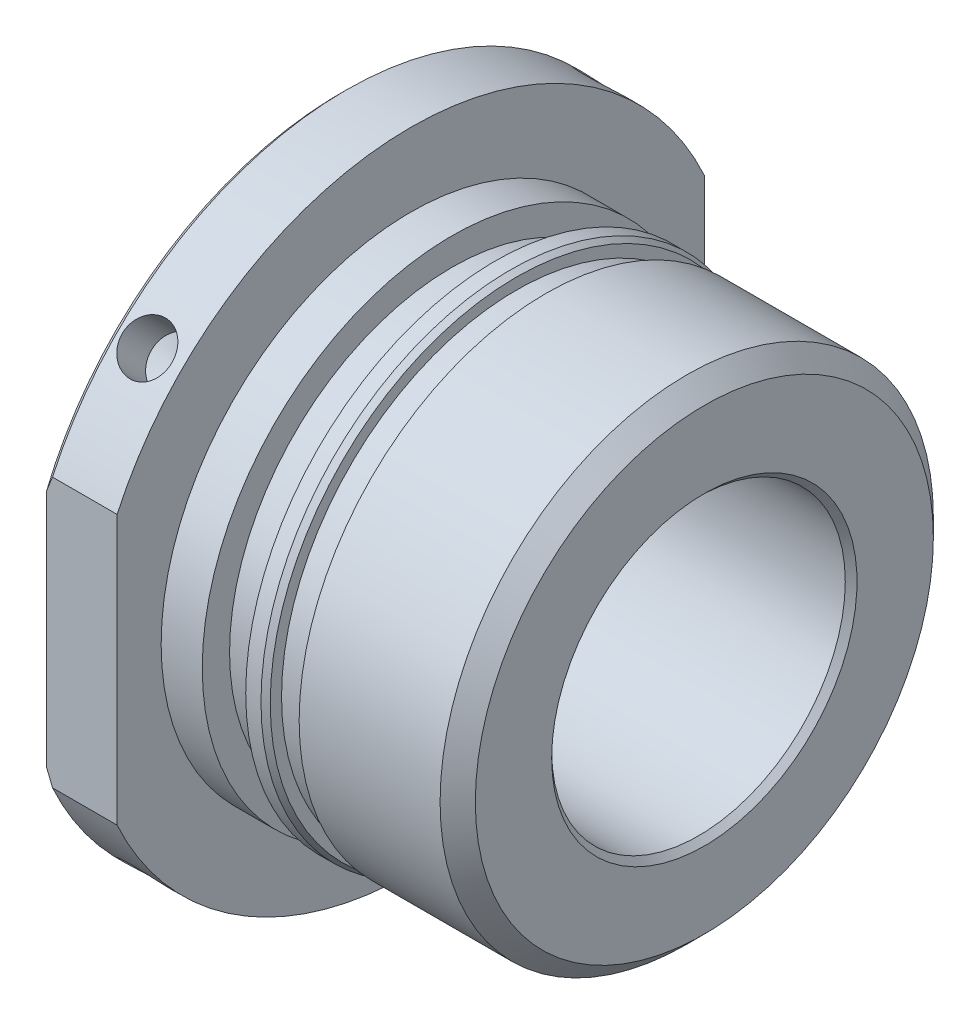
ISO-10303-21;
HEADER;
FILE_DESCRIPTION(('STEP AP214'),'2;1');
FILE_NAME('part.step','',(''),(''),'','','');
FILE_SCHEMA(('AUTOMOTIVE_DESIGN { 1 0 10303 214 1 1 1 1 }'));
ENDSEC;
DATA;
#1=APPLICATION_CONTEXT('core data for automotive mechanical design processes');
#2=APPLICATION_PROTOCOL_DEFINITION('international standard','automotive_design',2000,#1);
#3=PRODUCT_CONTEXT('',#1,'mechanical');
#4=PRODUCT('Part','Part','',(#3));
#5=PRODUCT_RELATED_PRODUCT_CATEGORY('part','',(#4));
#6=PRODUCT_DEFINITION_FORMATION('','',#4);
#7=PRODUCT_DEFINITION_CONTEXT('part definition',#1,'design');
#8=PRODUCT_DEFINITION('design','',#6,#7);
#9=PRODUCT_DEFINITION_SHAPE('','',#8);
#10=(LENGTH_UNIT() NAMED_UNIT(*) SI_UNIT(.MILLI.,.METRE.));
#11=(NAMED_UNIT(*) PLANE_ANGLE_UNIT() SI_UNIT($,.RADIAN.));
#12=(NAMED_UNIT(*) SI_UNIT($,.STERADIAN.) SOLID_ANGLE_UNIT());
#13=UNCERTAINTY_MEASURE_WITH_UNIT(LENGTH_MEASURE(1.E-05),#10,'distance_accuracy_value','');
#14=(GEOMETRIC_REPRESENTATION_CONTEXT(3) GLOBAL_UNCERTAINTY_ASSIGNED_CONTEXT((#13)) GLOBAL_UNIT_ASSIGNED_CONTEXT((#10,
#11,#12)) REPRESENTATION_CONTEXT('',''));
#15=CARTESIAN_POINT('',(0.,0.,0.));
#16=DIRECTION('',(0.,0.,1.));
#17=DIRECTION('',(1.,0.,0.));
#18=AXIS2_PLACEMENT_3D('',#15,#16,#17);
#19=CARTESIAN_POINT('',(12.,42.5,0.));
#20=DIRECTION('',(-1.,0.,0.));
#21=DIRECTION('',(0.,0.,1.));
#22=AXIS2_PLACEMENT_3D('',#19,#20,#21);
#23=PLANE('',#22);
#24=CARTESIAN_POINT('',(12.,0.,0.));
#25=DIRECTION('',(-1.,0.,0.));
#26=DIRECTION('',(0.,0.,1.));
#27=AXIS2_PLACEMENT_3D('',#24,#25,#26);
#28=CIRCLE('',#27,42.5);
#29=CARTESIAN_POINT('',(12.,0.,42.5));
#30=VERTEX_POINT('',#29);
#31=EDGE_CURVE('E200',#30,#30,#28,.T.);
#32=ORIENTED_EDGE('',*,*,#31,.T.);
#33=EDGE_LOOP('',(#32));
#34=FACE_BOUND('',#33,.T.);
#35=DIRECTION('',(0.,-1.,0.));
#36=VECTOR('',#35,1.);
#37=CARTESIAN_POINT('',(12.,42.5,-50.));
#38=LINE('',#37,#36);
#39=CARTESIAN_POINT('',(12.,22.9128784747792,-50.));
#40=VERTEX_POINT('',#39);
#41=CARTESIAN_POINT('',(12.,-22.9128784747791,-50.));
#42=VERTEX_POINT('',#41);
#43=EDGE_CURVE('E157',#40,#42,#38,.T.);
#44=ORIENTED_EDGE('',*,*,#43,.F.);
#45=CARTESIAN_POINT('',(12.,0.,0.));
#46=DIRECTION('',(-1.,0.,0.));
#47=DIRECTION('',(0.,0.,1.));
#48=AXIS2_PLACEMENT_3D('',#45,#46,#47);
#49=CIRCLE('',#48,55.);
#50=CARTESIAN_POINT('',(12.,22.9128784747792,50.));
#51=VERTEX_POINT('',#50);
#52=EDGE_CURVE('E197',#51,#40,#49,.T.);
#53=ORIENTED_EDGE('',*,*,#52,.F.);
#54=DIRECTION('',(0.,1.,0.));
#55=VECTOR('',#54,1.);
#56=CARTESIAN_POINT('',(12.,42.5,50.));
#57=LINE('',#56,#55);
#58=CARTESIAN_POINT('',(12.,-22.9128784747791,50.));
#59=VERTEX_POINT('',#58);
#60=EDGE_CURVE('E300',#59,#51,#57,.T.);
#61=ORIENTED_EDGE('',*,*,#60,.F.);
#62=EDGE_CURVE('E196',#42,#59,#49,.T.);
#63=ORIENTED_EDGE('',*,*,#62,.F.);
#64=EDGE_LOOP('',(#44,#53,#61,#63));
#65=FACE_BOUND('',#64,.T.);
#66=ADVANCED_FACE('F34',(#34,#65),#23,.F.);
#67=CARTESIAN_POINT('',(0.,0.,0.));
#68=DIRECTION('',(-1.,0.,0.));
#69=DIRECTION('',(0.,0.,1.));
#70=AXIS2_PLACEMENT_3D('',#67,#68,#69);
#71=CYLINDRICAL_SURFACE('',#70,55.);
#72=CARTESIAN_POINT('',(6.,-41.7797927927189,35.7693851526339));
#73=CARTESIAN_POINT('',(5.76165829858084,-41.7797869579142,35.7693940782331));
#74=CARTESIAN_POINT('',(5.52315285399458,-41.7666786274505,35.7847205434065));
#75=CARTESIAN_POINT('',(5.05273679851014,-41.7144868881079,35.8455454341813));
#76=CARTESIAN_POINT('',(4.82083404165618,-41.6753737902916,35.8910783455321));
#77=CARTESIAN_POINT('',(4.37050491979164,-41.5720354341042,36.010721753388));
#78=CARTESIAN_POINT('',(4.15207116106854,-41.507824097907,36.0848164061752));
#79=CARTESIAN_POINT('',(3.73477320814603,-41.3557199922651,36.2590365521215));
#80=CARTESIAN_POINT('',(3.5359047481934,-41.2678324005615,36.3591563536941));
#81=CARTESIAN_POINT('',(3.16288618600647,-41.0701435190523,36.5823114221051));
#82=CARTESIAN_POINT('',(2.9887855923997,-40.9602993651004,36.7053914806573));
#83=CARTESIAN_POINT('',(2.67066975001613,-40.7213409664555,36.9703143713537));
#84=CARTESIAN_POINT('',(2.52665579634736,-40.5922258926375,37.1121580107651));
#85=CARTESIAN_POINT('',(2.27263966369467,-40.3176572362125,37.4102601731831));
#86=CARTESIAN_POINT('',(2.16267985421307,-40.1721836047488,37.5665363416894));
#87=CARTESIAN_POINT('',(1.98016442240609,-39.8686933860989,37.8884701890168));
#88=CARTESIAN_POINT('',(1.90760822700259,-39.710676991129,38.0541277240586));
#89=CARTESIAN_POINT('',(1.8021008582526,-39.3866037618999,38.3894474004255));
#90=CARTESIAN_POINT('',(1.76907020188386,-39.2205637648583,38.5591008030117));
#91=CARTESIAN_POINT('',(1.74330589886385,-38.884728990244,38.8977468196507));
#92=CARTESIAN_POINT('',(1.75057159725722,-38.7149342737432,39.0667394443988));
#93=CARTESIAN_POINT('',(1.80512858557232,-38.3768280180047,39.398923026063));
#94=CARTESIAN_POINT('',(1.85233439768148,-38.2085140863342,39.5621255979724));
#95=CARTESIAN_POINT('',(1.98529878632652,-37.8779823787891,39.8787017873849));
#96=CARTESIAN_POINT('',(2.07105768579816,-37.715764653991,40.0320753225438));
#97=CARTESIAN_POINT('',(2.27878962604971,-37.4022013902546,40.3251967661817));
#98=CARTESIAN_POINT('',(2.40080109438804,-37.2508676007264,40.4649300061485));
#99=CARTESIAN_POINT('',(2.67754680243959,-36.9639996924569,40.7271476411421));
#100=CARTESIAN_POINT('',(2.83228161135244,-36.8284658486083,40.8496317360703));
#101=CARTESIAN_POINT('',(3.17056372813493,-36.5772202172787,41.0747556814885));
#102=CARTESIAN_POINT('',(3.35418528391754,-36.4615611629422,41.1773428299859));
#103=CARTESIAN_POINT('',(3.74476936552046,-36.2543235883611,41.3599221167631));
#104=CARTESIAN_POINT('',(3.9517319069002,-36.1627450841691,41.4399142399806));
#105=CARTESIAN_POINT('',(4.38317381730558,-36.0067609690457,41.5755204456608));
#106=CARTESIAN_POINT('',(4.60765493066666,-35.9423580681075,41.6311320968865));
#107=CARTESIAN_POINT('',(5.06773786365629,-35.8429669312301,41.7167359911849));
#108=CARTESIAN_POINT('',(5.30333948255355,-35.8079781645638,41.7467286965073));
#109=CARTESIAN_POINT('',(5.77832384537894,-35.7686921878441,41.7803942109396));
#110=CARTESIAN_POINT('',(6.01769524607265,-35.7643159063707,41.7841348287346));
#111=CARTESIAN_POINT('',(6.49399696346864,-35.7861990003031,41.7653942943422));
#112=CARTESIAN_POINT('',(6.73092729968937,-35.8124581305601,41.7429133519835));
#113=CARTESIAN_POINT('',(7.19532457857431,-35.8946411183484,41.6722646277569));
#114=CARTESIAN_POINT('',(7.42280281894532,-35.9505283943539,41.62412852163));
#115=CARTESIAN_POINT('',(7.8621882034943,-36.0900178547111,41.5032417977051));
#116=CARTESIAN_POINT('',(8.07409513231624,-36.1736204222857,41.430490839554));
#117=CARTESIAN_POINT('',(8.47679848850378,-36.3659100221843,41.2618094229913));
#118=CARTESIAN_POINT('',(8.66755085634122,-36.4746480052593,41.1658318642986));
#119=CARTESIAN_POINT('',(9.02208549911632,-36.7135064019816,40.9529482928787));
#120=CARTESIAN_POINT('',(9.18586737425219,-36.8436271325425,40.8360419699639));
#121=CARTESIAN_POINT('',(9.48216519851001,-37.1213340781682,40.5837622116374));
#122=CARTESIAN_POINT('',(9.61461375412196,-37.2689569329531,40.4483499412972));
#123=CARTESIAN_POINT('',(9.84402320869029,-37.576758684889,40.1625603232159));
#124=CARTESIAN_POINT('',(9.94098441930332,-37.7369374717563,40.0121831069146));
#125=CARTESIAN_POINT('',(10.0965505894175,-38.0647138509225,39.7004862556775));
#126=CARTESIAN_POINT('',(10.1551975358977,-38.2323031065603,39.539178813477));
#127=CARTESIAN_POINT('',(10.2326076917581,-38.5700276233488,39.2098020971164));
#128=CARTESIAN_POINT('',(10.2513715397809,-38.7401628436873,39.0417329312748));
#129=CARTESIAN_POINT('',(10.2484758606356,-39.0775924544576,38.7039869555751));
#130=CARTESIAN_POINT('',(10.2269214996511,-39.2448930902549,38.5343154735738));
#131=CARTESIAN_POINT('',(10.1442201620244,-39.5724549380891,38.197852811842));
#132=CARTESIAN_POINT('',(10.0830731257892,-39.73271613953,38.0310616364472));
#133=CARTESIAN_POINT('',(9.92294804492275,-40.0419304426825,37.7053613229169));
#134=CARTESIAN_POINT('',(9.82397146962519,-40.1908839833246,37.5464518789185));
#135=CARTESIAN_POINT('',(9.59100948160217,-40.4737122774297,37.2414008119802));
#136=CARTESIAN_POINT('',(9.45702473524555,-40.6075873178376,37.0952589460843));
#137=CARTESIAN_POINT('',(9.15745584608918,-40.8573341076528,36.8200072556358));
#138=CARTESIAN_POINT('',(8.99179423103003,-40.9731604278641,36.6909405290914));
#139=CARTESIAN_POINT('',(8.63370665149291,-41.1837301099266,36.4544307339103));
#140=CARTESIAN_POINT('',(8.44127419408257,-41.2784683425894,36.3469929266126));
#141=CARTESIAN_POINT('',(8.03478380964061,-41.444816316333,36.1572012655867));
#142=CARTESIAN_POINT('',(7.82069035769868,-41.5163872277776,36.0748895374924));
#143=CARTESIAN_POINT('',(7.37736284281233,-41.6345274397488,35.9384799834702));
#144=CARTESIAN_POINT('',(7.14814663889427,-41.6811256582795,35.8843495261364));
#145=CARTESIAN_POINT('',(6.76463474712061,-41.7363799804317,35.8200448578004));
#146=CARTESIAN_POINT('',(6.61280982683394,-41.7526427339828,35.801076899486));
#147=CARTESIAN_POINT('',(6.30734596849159,-41.7743510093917,35.7757441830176));
#148=CARTESIAN_POINT('',(6.15370703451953,-41.779796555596,35.7693793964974));
#149=CARTESIAN_POINT('',(6.,-41.7797927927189,35.7693851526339));
#150=B_SPLINE_CURVE_WITH_KNOTS('',3,(#72,#73,#74,#75,#76,#77,#78,#79,#80,#81,#82,#83,#84,#85,
#86,#87,#88,#89,#90,#91,#92,#93,#94,#95,#96,#97,#98,#99,#100,#101,#102,#103,#104,#105,#106,#107,
#108,#109,#110,#111,#112,#113,#114,#115,#116,#117,#118,#119,#120,#121,#122,#123,#124,#125,#126,
#127,#128,#129,#130,#131,#132,#133,#134,#135,#136,#137,#138,#139,#140,#141,#142,#143,#144,#145,
#146,#147,#148,#149),.UNSPECIFIED.,.T.,.F.,(4,2,2,2,2,2,2,2,2,2,2,2,2,2,2,2,2,2,2,2,2,2,2,2,2,2,
2,2,2,2,2,2,2,2,2,2,2,2,4),(0.,0.714463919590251,1.42974492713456,2.14462972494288,
2.85935831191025,3.57549608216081,4.29166467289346,5.00872075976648,5.72576585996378,
6.44136659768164,7.15695570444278,7.87101720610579,8.58508468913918,9.29991179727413,
10.0147513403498,10.7314592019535,11.4481675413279,12.1649473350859,12.8817141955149,
13.5966289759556,14.3115380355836,15.0255664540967,15.7396047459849,16.455103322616,
17.17061250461,17.8876469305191,18.6046750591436,19.3209161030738,20.0371456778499,
20.7515096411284,21.4658746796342,22.1802119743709,22.8945356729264,23.6106292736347,
24.3268968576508,25.0443588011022,25.7609881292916,26.22174836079,26.682507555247),.UNSPECIFIED.);
#151=CARTESIAN_POINT('',(6.,-41.7797927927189,35.7693851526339));
#152=VERTEX_POINT('',#151);
#153=EDGE_CURVE('E46',#152,#152,#150,.T.);
#154=ORIENTED_EDGE('',*,*,#153,.T.);
#155=EDGE_LOOP('',(#154));
#156=FACE_BOUND('',#155,.T.);
#157=CARTESIAN_POINT('',(6.,-35.7693851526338,-41.779792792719));
#158=CARTESIAN_POINT('',(5.76165829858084,-35.769394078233,-41.7797869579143));
#159=CARTESIAN_POINT('',(5.52315285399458,-35.7847205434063,-41.7666786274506));
#160=CARTESIAN_POINT('',(5.05273679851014,-35.8455454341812,-41.714486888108));
#161=CARTESIAN_POINT('',(4.82083404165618,-35.8910783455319,-41.6753737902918));
#162=CARTESIAN_POINT('',(4.37050491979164,-36.0107217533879,-41.5720354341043));
#163=CARTESIAN_POINT('',(4.15207116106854,-36.0848164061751,-41.5078240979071));
#164=CARTESIAN_POINT('',(3.73477320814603,-36.2590365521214,-41.3557199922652));
#165=CARTESIAN_POINT('',(3.5359047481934,-36.359156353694,-41.2678324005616));
#166=CARTESIAN_POINT('',(3.16288618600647,-36.582311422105,-41.0701435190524));
#167=CARTESIAN_POINT('',(2.98878559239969,-36.7053914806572,-40.9602993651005));
#168=CARTESIAN_POINT('',(2.67066975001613,-36.9703143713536,-40.7213409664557));
#169=CARTESIAN_POINT('',(2.52665579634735,-37.1121580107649,-40.5922258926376));
#170=CARTESIAN_POINT('',(2.27263966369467,-37.410260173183,-40.3176572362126));
#171=CARTESIAN_POINT('',(2.16267985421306,-37.5665363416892,-40.1721836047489));
#172=CARTESIAN_POINT('',(1.98016442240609,-37.8884701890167,-39.868693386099));
#173=CARTESIAN_POINT('',(1.90760822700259,-38.0541277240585,-39.7106769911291));
#174=CARTESIAN_POINT('',(1.8021008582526,-38.3894474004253,-39.3866037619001));
#175=CARTESIAN_POINT('',(1.76907020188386,-38.5591008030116,-39.2205637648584));
#176=CARTESIAN_POINT('',(1.74330589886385,-38.8977468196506,-38.8847289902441));
#177=CARTESIAN_POINT('',(1.75057159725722,-39.0667394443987,-38.7149342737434));
#178=CARTESIAN_POINT('',(1.80512858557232,-39.3989230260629,-38.3768280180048));
#179=CARTESIAN_POINT('',(1.85233439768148,-39.5621255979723,-38.2085140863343));
#180=CARTESIAN_POINT('',(1.98529878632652,-39.8787017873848,-37.8779823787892));
#181=CARTESIAN_POINT('',(2.07105768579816,-40.0320753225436,-37.7157646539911));
#182=CARTESIAN_POINT('',(2.27878962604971,-40.3251967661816,-37.4022013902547));
#183=CARTESIAN_POINT('',(2.40080109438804,-40.4649300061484,-37.2508676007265));
#184=CARTESIAN_POINT('',(2.67754680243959,-40.727147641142,-36.9639996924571));
#185=CARTESIAN_POINT('',(2.83228161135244,-40.8496317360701,-36.8284658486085));
#186=CARTESIAN_POINT('',(3.17056372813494,-41.0747556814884,-36.5772202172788));
#187=CARTESIAN_POINT('',(3.35418528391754,-41.1773428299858,-36.4615611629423));
#188=CARTESIAN_POINT('',(3.74476936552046,-41.359922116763,-36.2543235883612));
#189=CARTESIAN_POINT('',(3.9517319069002,-41.4399142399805,-36.1627450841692));
#190=CARTESIAN_POINT('',(4.38317381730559,-41.5755204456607,-36.0067609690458));
#191=CARTESIAN_POINT('',(4.60765493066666,-41.6311320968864,-35.9423580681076));
#192=CARTESIAN_POINT('',(5.06773786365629,-41.7167359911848,-35.8429669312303));
#193=CARTESIAN_POINT('',(5.30333948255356,-41.7467286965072,-35.8079781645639));
#194=CARTESIAN_POINT('',(5.77832384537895,-41.7803942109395,-35.7686921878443));
#195=CARTESIAN_POINT('',(6.01769524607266,-41.7841348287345,-35.7643159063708));
#196=CARTESIAN_POINT('',(6.49399696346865,-41.7653942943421,-35.7861990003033));
#197=CARTESIAN_POINT('',(6.73092729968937,-41.7429133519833,-35.8124581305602));
#198=CARTESIAN_POINT('',(7.19532457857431,-41.6722646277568,-35.8946411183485));
#199=CARTESIAN_POINT('',(7.42280281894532,-41.6241285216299,-35.9505283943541));
#200=CARTESIAN_POINT('',(7.8621882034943,-41.503241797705,-36.0900178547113));
#201=CARTESIAN_POINT('',(8.07409513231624,-41.4304908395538,-36.1736204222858));
#202=CARTESIAN_POINT('',(8.47679848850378,-41.2618094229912,-36.3659100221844));
#203=CARTESIAN_POINT('',(8.66755085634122,-41.1658318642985,-36.4746480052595));
#204=CARTESIAN_POINT('',(9.02208549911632,-40.9529482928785,-36.7135064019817));
#205=CARTESIAN_POINT('',(9.1858673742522,-40.8360419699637,-36.8436271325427));
#206=CARTESIAN_POINT('',(9.48216519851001,-40.5837622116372,-37.1213340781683));
#207=CARTESIAN_POINT('',(9.61461375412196,-40.4483499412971,-37.2689569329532));
#208=CARTESIAN_POINT('',(9.84402320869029,-40.1625603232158,-37.5767586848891));
#209=CARTESIAN_POINT('',(9.94098441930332,-40.0121831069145,-37.7369374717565));
#210=CARTESIAN_POINT('',(10.0965505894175,-39.7004862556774,-38.0647138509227));
#211=CARTESIAN_POINT('',(10.1551975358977,-39.5391788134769,-38.2323031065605));
#212=CARTESIAN_POINT('',(10.2326076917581,-39.2098020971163,-38.5700276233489));
#213=CARTESIAN_POINT('',(10.2513715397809,-39.0417329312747,-38.7401628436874));
#214=CARTESIAN_POINT('',(10.2484758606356,-38.703986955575,-39.0775924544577));
#215=CARTESIAN_POINT('',(10.2269214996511,-38.5343154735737,-39.2448930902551));
#216=CARTESIAN_POINT('',(10.1442201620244,-38.1978528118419,-39.5724549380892));
#217=CARTESIAN_POINT('',(10.0830731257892,-38.0310616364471,-39.7327161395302));
#218=CARTESIAN_POINT('',(9.92294804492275,-37.7053613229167,-40.0419304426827));
#219=CARTESIAN_POINT('',(9.82397146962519,-37.5464518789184,-40.1908839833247));
#220=CARTESIAN_POINT('',(9.59100948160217,-37.2414008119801,-40.4737122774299));
#221=CARTESIAN_POINT('',(9.45702473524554,-37.0952589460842,-40.6075873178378));
#222=CARTESIAN_POINT('',(9.15745584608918,-36.8200072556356,-40.8573341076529));
#223=CARTESIAN_POINT('',(8.99179423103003,-36.6909405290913,-40.9731604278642));
#224=CARTESIAN_POINT('',(8.63370665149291,-36.4544307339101,-41.1837301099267));
#225=CARTESIAN_POINT('',(8.44127419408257,-36.3469929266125,-41.2784683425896));
#226=CARTESIAN_POINT('',(8.0347838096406,-36.1572012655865,-41.4448163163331));
#227=CARTESIAN_POINT('',(7.82069035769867,-36.0748895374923,-41.5163872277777));
#228=CARTESIAN_POINT('',(7.37736284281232,-35.93847998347,-41.6345274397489));
#229=CARTESIAN_POINT('',(7.14814663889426,-35.8843495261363,-41.6811256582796));
#230=CARTESIAN_POINT('',(6.76463474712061,-35.8200448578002,-41.7363799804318));
#231=CARTESIAN_POINT('',(6.61280982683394,-35.8010768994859,-41.7526427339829));
#232=CARTESIAN_POINT('',(6.30734596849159,-35.7757441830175,-41.7743510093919));
#233=CARTESIAN_POINT('',(6.15370703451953,-35.7693793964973,-41.7797965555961));
#234=CARTESIAN_POINT('',(6.,-35.7693851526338,-41.779792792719));
#235=B_SPLINE_CURVE_WITH_KNOTS('',3,(#157,#158,#159,#160,#161,#162,#163,#164,#165,#166,#167,
#168,#169,#170,#171,#172,#173,#174,#175,#176,#177,#178,#179,#180,#181,#182,#183,#184,#185,#186,
#187,#188,#189,#190,#191,#192,#193,#194,#195,#196,#197,#198,#199,#200,#201,#202,#203,#204,#205,
#206,#207,#208,#209,#210,#211,#212,#213,#214,#215,#216,#217,#218,#219,#220,#221,#222,#223,#224,
#225,#226,#227,#228,#229,#230,#231,#232,#233,#234),.UNSPECIFIED.,.T.,.F.,(4,2,2,2,2,2,2,2,2,2,2,
2,2,2,2,2,2,2,2,2,2,2,2,2,2,2,2,2,2,2,2,2,2,2,2,2,2,2,4),(0.,0.714463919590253,1.42974492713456,
2.14462972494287,2.85935831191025,3.57549608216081,4.29166467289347,5.00872075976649,
5.72576585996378,6.44136659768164,7.15695570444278,7.87101720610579,8.58508468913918,
9.29991179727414,10.0147513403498,10.7314592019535,11.4481675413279,12.1649473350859,
12.8817141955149,13.5966289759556,14.3115380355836,15.0255664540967,15.7396047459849,
16.455103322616,17.17061250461,17.8876469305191,18.6046750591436,19.3209161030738,
20.0371456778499,20.7515096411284,21.4658746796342,22.1802119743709,22.8945356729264,
23.6106292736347,24.3268968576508,25.0443588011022,25.7609881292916,26.22174836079,
26.682507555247),.UNSPECIFIED.);
#236=CARTESIAN_POINT('',(6.,-35.7693851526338,-41.779792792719));
#237=VERTEX_POINT('',#236);
#238=EDGE_CURVE('E251',#237,#237,#235,.T.);
#239=ORIENTED_EDGE('',*,*,#238,.T.);
#240=EDGE_LOOP('',(#239));
#241=FACE_BOUND('',#240,.T.);
#242=DIRECTION('',(-1.,0.,0.));
#243=VECTOR('',#242,1.);
#244=CARTESIAN_POINT('',(0.,-22.9128784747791,-50.));
#245=LINE('',#244,#243);
#246=CARTESIAN_POINT('',(1.,-22.9128784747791,-50.));
#247=VERTEX_POINT('',#246);
#248=EDGE_CURVE('E159',#42,#247,#245,.T.);
#249=ORIENTED_EDGE('',*,*,#248,.F.);
#250=ORIENTED_EDGE('',*,*,#62,.T.);
#251=DIRECTION('',(-1.,0.,0.));
#252=VECTOR('',#251,1.);
#253=CARTESIAN_POINT('',(0.,-22.9128784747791,50.));
#254=LINE('',#253,#252);
#255=CARTESIAN_POINT('',(0.999999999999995,-22.9128784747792,50.));
#256=VERTEX_POINT('',#255);
#257=EDGE_CURVE('E128',#256,#59,#254,.F.);
#258=ORIENTED_EDGE('',*,*,#257,.F.);
#259=CARTESIAN_POINT('',(1.,0.,0.));
#260=DIRECTION('',(-1.,0.,0.));
#261=DIRECTION('',(0.,0.,1.));
#262=AXIS2_PLACEMENT_3D('',#259,#260,#261);
#263=CIRCLE('',#262,55.);
#264=EDGE_CURVE('E192',#247,#256,#263,.T.);
#265=ORIENTED_EDGE('',*,*,#264,.F.);
#266=EDGE_LOOP('',(#249,#250,#258,#265));
#267=FACE_BOUND('',#266,.T.);
#268=ADVANCED_FACE('F255',(#156,#241,#267),#71,.T.);
#269=CARTESIAN_POINT('',(6.,35.7693851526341,41.7797927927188));
#270=CARTESIAN_POINT('',(5.76165829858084,35.7693940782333,41.7797869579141));
#271=CARTESIAN_POINT('',(5.52315285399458,35.7847205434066,41.7666786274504));
#272=CARTESIAN_POINT('',(5.05273679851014,35.8455454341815,41.7144868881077));
#273=CARTESIAN_POINT('',(4.82083404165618,35.8910783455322,41.6753737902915));
#274=CARTESIAN_POINT('',(4.37050491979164,36.0107217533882,41.5720354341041));
#275=CARTESIAN_POINT('',(4.15207116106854,36.0848164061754,41.5078240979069));
#276=CARTESIAN_POINT('',(3.73477320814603,36.2590365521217,41.355719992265));
#277=CARTESIAN_POINT('',(3.5359047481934,36.3591563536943,41.2678324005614));
#278=CARTESIAN_POINT('',(3.16288618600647,36.5823114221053,41.0701435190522));
#279=CARTESIAN_POINT('',(2.9887855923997,36.7053914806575,40.9602993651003));
#280=CARTESIAN_POINT('',(2.67066975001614,36.9703143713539,40.7213409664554));
#281=CARTESIAN_POINT('',(2.52665579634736,37.1121580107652,40.5922258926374));
#282=CARTESIAN_POINT('',(2.27263966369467,37.4102601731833,40.3176572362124));
#283=CARTESIAN_POINT('',(2.16267985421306,37.5665363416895,40.1721836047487));
#284=CARTESIAN_POINT('',(1.98016442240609,37.888470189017,39.8686933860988));
#285=CARTESIAN_POINT('',(1.90760822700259,38.0541277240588,39.7106769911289));
#286=CARTESIAN_POINT('',(1.8021008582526,38.3894474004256,39.3866037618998));
#287=CARTESIAN_POINT('',(1.76907020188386,38.5591008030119,39.2205637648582));
#288=CARTESIAN_POINT('',(1.74330589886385,38.8977468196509,38.8847289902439));
#289=CARTESIAN_POINT('',(1.75057159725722,39.066739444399,38.7149342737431));
#290=CARTESIAN_POINT('',(1.80512858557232,39.3989230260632,38.3768280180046));
#291=CARTESIAN_POINT('',(1.85233439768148,39.5621255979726,38.2085140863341));
#292=CARTESIAN_POINT('',(1.98529878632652,39.878701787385,37.8779823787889));
#293=CARTESIAN_POINT('',(2.07105768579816,40.0320753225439,37.7157646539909));
#294=CARTESIAN_POINT('',(2.27878962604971,40.3251967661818,37.4022013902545));
#295=CARTESIAN_POINT('',(2.40080109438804,40.4649300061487,37.2508676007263));
#296=CARTESIAN_POINT('',(2.67754680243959,40.7271476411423,36.9639996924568));
#297=CARTESIAN_POINT('',(2.83228161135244,40.8496317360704,36.8284658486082));
#298=CARTESIAN_POINT('',(3.17056372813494,41.0747556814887,36.5772202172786));
#299=CARTESIAN_POINT('',(3.35418528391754,41.1773428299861,36.4615611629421));
#300=CARTESIAN_POINT('',(3.74476936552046,41.3599221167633,36.254323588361));
#301=CARTESIAN_POINT('',(3.9517319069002,41.4399142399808,36.162745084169));
#302=CARTESIAN_POINT('',(4.38317381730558,41.5755204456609,36.0067609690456));
#303=CARTESIAN_POINT('',(4.60765493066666,41.6311320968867,35.9423580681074));
#304=CARTESIAN_POINT('',(5.06773786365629,41.7167359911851,35.84296693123));
#305=CARTESIAN_POINT('',(5.30333948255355,41.7467286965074,35.8079781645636));
#306=CARTESIAN_POINT('',(5.77832384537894,41.7803942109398,35.768692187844));
#307=CARTESIAN_POINT('',(6.01769524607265,41.7841348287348,35.7643159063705));
#308=CARTESIAN_POINT('',(6.49399696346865,41.7653942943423,35.786199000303));
#309=CARTESIAN_POINT('',(6.73092729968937,41.7429133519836,35.81245813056));
#310=CARTESIAN_POINT('',(7.19532457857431,41.6722646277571,35.8946411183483));
#311=CARTESIAN_POINT('',(7.42280281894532,41.6241285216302,35.9505283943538));
#312=CARTESIAN_POINT('',(7.8621882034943,41.5032417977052,36.090017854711));
#313=CARTESIAN_POINT('',(8.07409513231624,41.4304908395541,36.1736204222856));
#314=CARTESIAN_POINT('',(8.47679848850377,41.2618094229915,36.3659100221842));
#315=CARTESIAN_POINT('',(8.66755085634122,41.1658318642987,36.4746480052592));
#316=CARTESIAN_POINT('',(9.02208549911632,40.9529482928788,36.7135064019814));
#317=CARTESIAN_POINT('',(9.18586737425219,40.836041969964,36.8436271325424));
#318=CARTESIAN_POINT('',(9.48216519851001,40.5837622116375,37.121334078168));
#319=CARTESIAN_POINT('',(9.61461375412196,40.4483499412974,37.268956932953));
#320=CARTESIAN_POINT('',(9.84402320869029,40.1625603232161,37.5767586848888));
#321=CARTESIAN_POINT('',(9.94098441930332,40.0121831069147,37.7369374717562));
#322=CARTESIAN_POINT('',(10.0965505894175,39.7004862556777,38.0647138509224));
#323=CARTESIAN_POINT('',(10.1551975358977,39.5391788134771,38.2323031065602));
#324=CARTESIAN_POINT('',(10.2326076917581,39.2098020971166,38.5700276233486));
#325=CARTESIAN_POINT('',(10.2513715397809,39.041732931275,38.7401628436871));
#326=CARTESIAN_POINT('',(10.2484758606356,38.7039869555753,39.0775924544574));
#327=CARTESIAN_POINT('',(10.2269214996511,38.534315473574,39.2448930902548));
#328=CARTESIAN_POINT('',(10.1442201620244,38.1978528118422,39.5724549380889));
#329=CARTESIAN_POINT('',(10.0830731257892,38.0310616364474,39.7327161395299));
#330=CARTESIAN_POINT('',(9.92294804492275,37.705361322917,40.0419304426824));
#331=CARTESIAN_POINT('',(9.82397146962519,37.5464518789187,40.1908839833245));
#332=CARTESIAN_POINT('',(9.59100948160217,37.2414008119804,40.4737122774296));
#333=CARTESIAN_POINT('',(9.45702473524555,37.0952589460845,40.6075873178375));
#334=CARTESIAN_POINT('',(9.15745584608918,36.8200072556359,40.8573341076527));
#335=CARTESIAN_POINT('',(8.99179423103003,36.6909405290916,40.973160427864));
#336=CARTESIAN_POINT('',(8.63370665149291,36.4544307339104,41.1837301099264));
#337=CARTESIAN_POINT('',(8.44127419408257,36.3469929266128,41.2784683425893));
#338=CARTESIAN_POINT('',(8.0347838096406,36.1572012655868,41.4448163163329));
#339=CARTESIAN_POINT('',(7.82069035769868,36.0748895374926,41.5163872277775));
#340=CARTESIAN_POINT('',(7.37736284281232,35.9384799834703,41.6345274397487));
#341=CARTESIAN_POINT('',(7.14814663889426,35.8843495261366,41.6811256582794));
#342=CARTESIAN_POINT('',(6.76463474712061,35.8200448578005,41.7363799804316));
#343=CARTESIAN_POINT('',(6.61280982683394,35.8010768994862,41.7526427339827));
#344=CARTESIAN_POINT('',(6.30734596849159,35.7757441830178,41.7743510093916));
#345=CARTESIAN_POINT('',(6.15370703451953,35.7693793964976,41.7797965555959));
#346=CARTESIAN_POINT('',(6.,35.7693851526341,41.7797927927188));
#347=B_SPLINE_CURVE_WITH_KNOTS('',3,(#269,#270,#271,#272,#273,#274,#275,#276,#277,#278,#279,
#280,#281,#282,#283,#284,#285,#286,#287,#288,#289,#290,#291,#292,#293,#294,#295,#296,#297,#298,
#299,#300,#301,#302,#303,#304,#305,#306,#307,#308,#309,#310,#311,#312,#313,#314,#315,#316,#317,
#318,#319,#320,#321,#322,#323,#324,#325,#326,#327,#328,#329,#330,#331,#332,#333,#334,#335,#336,
#337,#338,#339,#340,#341,#342,#343,#344,#345,#346),.UNSPECIFIED.,.T.,.F.,(4,2,2,2,2,2,2,2,2,2,2,
2,2,2,2,2,2,2,2,2,2,2,2,2,2,2,2,2,2,2,2,2,2,2,2,2,2,2,4),(0.,0.714463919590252,1.42974492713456,
2.14462972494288,2.85935831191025,3.57549608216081,4.29166467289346,5.00872075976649,
5.72576585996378,6.44136659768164,7.15695570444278,7.87101720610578,8.58508468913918,
9.29991179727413,10.0147513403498,10.7314592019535,11.4481675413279,12.1649473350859,
12.8817141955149,13.5966289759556,14.3115380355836,15.0255664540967,15.7396047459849,
16.455103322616,17.17061250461,17.8876469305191,18.6046750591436,19.3209161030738,
20.0371456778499,20.7515096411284,21.4658746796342,22.1802119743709,22.8945356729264,
23.6106292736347,24.3268968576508,25.0443588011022,25.7609881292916,26.22174836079,
26.682507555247),.UNSPECIFIED.);
#348=CARTESIAN_POINT('',(6.,35.7693851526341,41.7797927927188));
#349=VERTEX_POINT('',#348);
#350=EDGE_CURVE('E12',#349,#349,#347,.T.);
#351=ORIENTED_EDGE('',*,*,#350,.T.);
#352=EDGE_LOOP('',(#351));
#353=FACE_BOUND('',#352,.T.);
#354=CARTESIAN_POINT('',(6.,41.7797927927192,-35.7693851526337));
#355=CARTESIAN_POINT('',(5.76165829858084,41.7797869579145,-35.7693940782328));
#356=CARTESIAN_POINT('',(5.52315285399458,41.7666786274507,-35.7847205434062));
#357=CARTESIAN_POINT('',(5.05273679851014,41.7144868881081,-35.8455454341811));
#358=CARTESIAN_POINT('',(4.82083404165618,41.6753737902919,-35.8910783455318));
#359=CARTESIAN_POINT('',(4.37050491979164,41.5720354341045,-36.0107217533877));
#360=CARTESIAN_POINT('',(4.15207116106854,41.5078240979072,-36.084816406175));
#361=CARTESIAN_POINT('',(3.73477320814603,41.3557199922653,-36.2590365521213));
#362=CARTESIAN_POINT('',(3.5359047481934,41.2678324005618,-36.3591563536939));
#363=CARTESIAN_POINT('',(3.16288618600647,41.0701435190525,-36.5823114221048));
#364=CARTESIAN_POINT('',(2.9887855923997,40.9602993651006,-36.705391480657));
#365=CARTESIAN_POINT('',(2.67066975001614,40.7213409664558,-36.9703143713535));
#366=CARTESIAN_POINT('',(2.52665579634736,40.5922258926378,-37.1121580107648));
#367=CARTESIAN_POINT('',(2.27263966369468,40.3176572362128,-37.4102601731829));
#368=CARTESIAN_POINT('',(2.16267985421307,40.1721836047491,-37.5665363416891));
#369=CARTESIAN_POINT('',(1.98016442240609,39.8686933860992,-37.8884701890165));
#370=CARTESIAN_POINT('',(1.90760822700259,39.7106769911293,-38.0541277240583));
#371=CARTESIAN_POINT('',(1.8021008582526,39.3866037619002,-38.3894474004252));
#372=CARTESIAN_POINT('',(1.76907020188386,39.2205637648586,-38.5591008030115));
#373=CARTESIAN_POINT('',(1.74330589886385,38.8847289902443,-38.8977468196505));
#374=CARTESIAN_POINT('',(1.75057159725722,38.7149342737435,-39.0667394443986));
#375=CARTESIAN_POINT('',(1.80512858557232,38.376828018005,-39.3989230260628));
#376=CARTESIAN_POINT('',(1.85233439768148,38.2085140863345,-39.5621255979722));
#377=CARTESIAN_POINT('',(1.98529878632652,37.8779823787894,-39.8787017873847));
#378=CARTESIAN_POINT('',(2.07105768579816,37.7157646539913,-40.0320753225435));
#379=CARTESIAN_POINT('',(2.27878962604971,37.4022013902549,-40.3251967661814));
#380=CARTESIAN_POINT('',(2.40080109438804,37.2508676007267,-40.4649300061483));
#381=CARTESIAN_POINT('',(2.67754680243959,36.9639996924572,-40.7271476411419));
#382=CARTESIAN_POINT('',(2.83228161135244,36.8284658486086,-40.84963173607));
#383=CARTESIAN_POINT('',(3.17056372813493,36.577220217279,-41.0747556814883));
#384=CARTESIAN_POINT('',(3.35418528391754,36.4615611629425,-41.1773428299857));
#385=CARTESIAN_POINT('',(3.74476936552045,36.2543235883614,-41.3599221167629));
#386=CARTESIAN_POINT('',(3.95173190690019,36.1627450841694,-41.4399142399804));
#387=CARTESIAN_POINT('',(4.38317381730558,36.006760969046,-41.5755204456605));
#388=CARTESIAN_POINT('',(4.60765493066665,35.9423580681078,-41.6311320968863));
#389=CARTESIAN_POINT('',(5.06773786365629,35.8429669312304,-41.7167359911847));
#390=CARTESIAN_POINT('',(5.30333948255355,35.8079781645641,-41.746728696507));
#391=CARTESIAN_POINT('',(5.77832384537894,35.7686921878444,-41.7803942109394));
#392=CARTESIAN_POINT('',(6.01769524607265,35.764315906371,-41.7841348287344));
#393=CARTESIAN_POINT('',(6.49399696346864,35.7861990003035,-41.765394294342));
#394=CARTESIAN_POINT('',(6.73092729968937,35.8124581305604,-41.7429133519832));
#395=CARTESIAN_POINT('',(7.19532457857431,35.8946411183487,-41.6722646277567));
#396=CARTESIAN_POINT('',(7.42280281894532,35.9505283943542,-41.6241285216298));
#397=CARTESIAN_POINT('',(7.8621882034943,36.0900178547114,-41.5032417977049));
#398=CARTESIAN_POINT('',(8.07409513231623,36.173620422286,-41.4304908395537));
#399=CARTESIAN_POINT('',(8.47679848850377,36.3659100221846,-41.2618094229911));
#400=CARTESIAN_POINT('',(8.66755085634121,36.4746480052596,-41.1658318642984));
#401=CARTESIAN_POINT('',(9.02208549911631,36.7135064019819,-40.9529482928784));
#402=CARTESIAN_POINT('',(9.18586737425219,36.8436271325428,-40.8360419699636));
#403=CARTESIAN_POINT('',(9.48216519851,37.1213340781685,-40.5837622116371));
#404=CARTESIAN_POINT('',(9.61461375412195,37.2689569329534,-40.448349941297));
#405=CARTESIAN_POINT('',(9.84402320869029,37.5767586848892,-40.1625603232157));
#406=CARTESIAN_POINT('',(9.94098441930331,37.7369374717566,-40.0121831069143));
#407=CARTESIAN_POINT('',(10.0965505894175,38.0647138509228,-39.7004862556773));
#408=CARTESIAN_POINT('',(10.1551975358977,38.2323031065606,-39.5391788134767));
#409=CARTESIAN_POINT('',(10.2326076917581,38.5700276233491,-39.2098020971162));
#410=CARTESIAN_POINT('',(10.2513715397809,38.7401628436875,-39.0417329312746));
#411=CARTESIAN_POINT('',(10.2484758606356,39.0775924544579,-38.7039869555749));
#412=CARTESIAN_POINT('',(10.2269214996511,39.2448930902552,-38.5343154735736));
#413=CARTESIAN_POINT('',(10.1442201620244,39.5724549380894,-38.1978528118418));
#414=CARTESIAN_POINT('',(10.0830731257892,39.7327161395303,-38.0310616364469));
#415=CARTESIAN_POINT('',(9.92294804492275,40.0419304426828,-37.7053613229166));
#416=CARTESIAN_POINT('',(9.82397146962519,40.1908839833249,-37.5464518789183));
#417=CARTESIAN_POINT('',(9.59100948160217,40.47371227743,-37.24140081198));
#418=CARTESIAN_POINT('',(9.45702473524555,40.6075873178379,-37.0952589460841));
#419=CARTESIAN_POINT('',(9.15745584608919,40.8573341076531,-36.8200072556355));
#420=CARTESIAN_POINT('',(8.99179423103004,40.9731604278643,-36.6909405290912));
#421=CARTESIAN_POINT('',(8.63370665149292,41.1837301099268,-36.45443073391));
#422=CARTESIAN_POINT('',(8.44127419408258,41.2784683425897,-36.3469929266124));
#423=CARTESIAN_POINT('',(8.03478380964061,41.4448163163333,-36.1572012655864));
#424=CARTESIAN_POINT('',(7.82069035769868,41.5163872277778,-36.0748895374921));
#425=CARTESIAN_POINT('',(7.37736284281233,41.6345274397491,-35.9384799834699));
#426=CARTESIAN_POINT('',(7.14814663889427,41.6811256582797,-35.8843495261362));
#427=CARTESIAN_POINT('',(6.76463474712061,41.7363799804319,-35.8200448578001));
#428=CARTESIAN_POINT('',(6.61280982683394,41.7526427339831,-35.8010768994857));
#429=CARTESIAN_POINT('',(6.30734596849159,41.774351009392,-35.7757441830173));
#430=CARTESIAN_POINT('',(6.15370703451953,41.7797965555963,-35.7693793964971));
#431=CARTESIAN_POINT('',(6.,41.7797927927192,-35.7693851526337));
#432=B_SPLINE_CURVE_WITH_KNOTS('',3,(#354,#355,#356,#357,#358,#359,#360,#361,#362,#363,#364,
#365,#366,#367,#368,#369,#370,#371,#372,#373,#374,#375,#376,#377,#378,#379,#380,#381,#382,#383,
#384,#385,#386,#387,#388,#389,#390,#391,#392,#393,#394,#395,#396,#397,#398,#399,#400,#401,#402,
#403,#404,#405,#406,#407,#408,#409,#410,#411,#412,#413,#414,#415,#416,#417,#418,#419,#420,#421,
#422,#423,#424,#425,#426,#427,#428,#429,#430,#431),.UNSPECIFIED.,.T.,.F.,(4,2,2,2,2,2,2,2,2,2,2,
2,2,2,2,2,2,2,2,2,2,2,2,2,2,2,2,2,2,2,2,2,2,2,2,2,2,2,4),(0.,0.714463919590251,1.42974492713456,
2.14462972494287,2.85935831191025,3.5754960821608,4.29166467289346,5.00872075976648,
5.72576585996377,6.44136659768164,7.15695570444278,7.87101720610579,8.58508468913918,
9.29991179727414,10.0147513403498,10.7314592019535,11.4481675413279,12.1649473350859,
12.8817141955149,13.5966289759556,14.3115380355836,15.0255664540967,15.7396047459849,
16.455103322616,17.17061250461,17.8876469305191,18.6046750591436,19.3209161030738,
20.0371456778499,20.7515096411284,21.4658746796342,22.1802119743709,22.8945356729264,
23.6106292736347,24.3268968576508,25.0443588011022,25.7609881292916,26.22174836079,
26.682507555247),.UNSPECIFIED.);
#433=CARTESIAN_POINT('',(6.,41.7797927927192,-35.7693851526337));
#434=VERTEX_POINT('',#433);
#435=EDGE_CURVE('E246',#434,#434,#432,.T.);
#436=ORIENTED_EDGE('',*,*,#435,.T.);
#437=EDGE_LOOP('',(#436));
#438=FACE_BOUND('',#437,.T.);
#439=DIRECTION('',(-1.,0.,0.));
#440=VECTOR('',#439,1.);
#441=CARTESIAN_POINT('',(0.,22.9128784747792,-50.));
#442=LINE('',#441,#440);
#443=CARTESIAN_POINT('',(0.999999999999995,22.9128784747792,-50.));
#444=VERTEX_POINT('',#443);
#445=EDGE_CURVE('E154',#444,#40,#442,.F.);
#446=ORIENTED_EDGE('',*,*,#445,.F.);
#447=CARTESIAN_POINT('',(1.,22.9128784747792,50.));
#448=VERTEX_POINT('',#447);
#449=EDGE_CURVE('E193',#448,#444,#263,.T.);
#450=ORIENTED_EDGE('',*,*,#449,.F.);
#451=DIRECTION('',(-1.,0.,0.));
#452=VECTOR('',#451,1.);
#453=CARTESIAN_POINT('',(0.,22.9128784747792,50.));
#454=LINE('',#453,#452);
#455=EDGE_CURVE('E155',#51,#448,#454,.T.);
#456=ORIENTED_EDGE('',*,*,#455,.F.);
#457=ORIENTED_EDGE('',*,*,#52,.T.);
#458=EDGE_LOOP('',(#446,#450,#456,#457));
#459=FACE_BOUND('',#458,.T.);
#460=ADVANCED_FACE('F289',(#353,#438,#459),#71,.T.);
#461=CARTESIAN_POINT('',(1.,0.,0.));
#462=DIRECTION('',(1.,0.,0.));
#463=DIRECTION('',(0.,0.,-1.));
#464=AXIS2_PLACEMENT_3D('',#461,#462,#463);
#465=CONICAL_SURFACE('',#464,55.,0.785398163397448);
#466=CARTESIAN_POINT('',(67.002927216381,-110.189420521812,-50.));
#467=CARTESIAN_POINT('',(65.5331815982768,-108.575390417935,-50.));
#468=CARTESIAN_POINT('',(64.0663984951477,-106.958655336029,-50.));
#469=CARTESIAN_POINT('',(61.1396662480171,-103.718986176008,-50.));
#470=CARTESIAN_POINT('',(59.6797171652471,-102.096052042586,-50.));
#471=CARTESIAN_POINT('',(56.767210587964,-98.8428027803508,-50.));
#472=CARTESIAN_POINT('',(55.3146551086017,-97.212485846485,-50.));
#473=CARTESIAN_POINT('',(52.4184701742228,-93.9439457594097,-50.));
#474=CARTESIAN_POINT('',(50.9748406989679,-92.3057226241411,-50.));
#475=CARTESIAN_POINT('',(48.0868154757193,-89.007623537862,-50.));
#476=CARTESIAN_POINT('',(46.642499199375,-87.3476779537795,-50.));
#477=CARTESIAN_POINT('',(43.7660298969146,-84.0172671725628,-50.));
#478=CARTESIAN_POINT('',(42.333876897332,-82.3468019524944,-50.));
#479=CARTESIAN_POINT('',(39.4840314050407,-78.993950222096,-50.));
#480=CARTESIAN_POINT('',(38.0663370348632,-77.3115653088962,-50.));
#481=CARTESIAN_POINT('',(35.2478342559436,-73.9327030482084,-50.));
#482=CARTESIAN_POINT('',(33.8470257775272,-72.2362257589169,-50.));
#483=CARTESIAN_POINT('',(31.2620929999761,-69.0676543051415,-50.));
#484=CARTESIAN_POINT('',(30.075317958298,-67.5977241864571,-50.));
#485=CARTESIAN_POINT('',(27.7192620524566,-64.6438833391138,-50.));
#486=CARTESIAN_POINT('',(26.5499812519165,-63.1599725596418,-50.));
#487=CARTESIAN_POINT('',(24.2317650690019,-60.1755169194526,-50.));
#488=CARTESIAN_POINT('',(23.082836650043,-58.6749666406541,-50.));
#489=CARTESIAN_POINT('',(20.8098191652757,-55.6551645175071,-50.));
#490=CARTESIAN_POINT('',(19.6857298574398,-54.1359128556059,-50.));
#491=CARTESIAN_POINT('',(17.4692597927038,-51.078016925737,-50.));
#492=CARTESIAN_POINT('',(16.3768318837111,-49.5394069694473,-50.));
#493=CARTESIAN_POINT('',(14.7655763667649,-47.2124645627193,-50.));
#494=CARTESIAN_POINT('',(14.2330349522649,-46.4336144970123,-50.));
#495=CARTESIAN_POINT('',(13.1781154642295,-44.8690670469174,-50.));
#496=CARTESIAN_POINT('',(12.6557372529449,-44.0833697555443,-50.));
#497=CARTESIAN_POINT('',(11.6225510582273,-42.5049987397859,-50.));
#498=CARTESIAN_POINT('',(11.1117370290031,-41.7123289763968,-50.));
#499=CARTESIAN_POINT('',(10.1027010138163,-40.1190280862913,-50.));
#500=CARTESIAN_POINT('',(9.60447877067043,-39.318397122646,-50.));
#501=CARTESIAN_POINT('',(8.62215350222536,-37.7086286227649,-50.));
#502=CARTESIAN_POINT('',(8.13804894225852,-36.8994920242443,-50.));
#503=CARTESIAN_POINT('',(7.18561227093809,-35.272007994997,-50.));
#504=CARTESIAN_POINT('',(6.71727966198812,-34.4536608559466,-50.));
#505=CARTESIAN_POINT('',(5.81355574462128,-32.8343975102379,-50.));
#506=CARTESIAN_POINT('',(5.37758702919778,-32.0338040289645,-50.));
#507=CARTESIAN_POINT('',(4.52417996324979,-30.4227941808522,-50.));
#508=CARTESIAN_POINT('',(4.10674139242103,-29.6123779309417,-50.));
#509=CARTESIAN_POINT('',(3.29258016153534,-27.9810541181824,-50.));
#510=CARTESIAN_POINT('',(2.89586015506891,-27.1601452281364,-50.));
#511=CARTESIAN_POINT('',(2.12570951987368,-25.5074464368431,-50.));
#512=CARTESIAN_POINT('',(1.75227891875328,-24.6756565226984,-50.));
#513=CARTESIAN_POINT('',(1.0321111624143,-23.0022323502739,-50.));
#514=CARTESIAN_POINT('',(0.685330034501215,-22.1606170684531,-50.));
#515=CARTESIAN_POINT('',(0.0207955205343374,-20.4659208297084,-50.));
#516=CARTESIAN_POINT('',(-0.296956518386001,-19.6128393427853,-50.));
#517=CARTESIAN_POINT('',(-0.900082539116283,-17.8954592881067,-50.));
#518=CARTESIAN_POINT('',(-1.18546291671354,-17.031162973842,-50.));
#519=CARTESIAN_POINT('',(-1.72048182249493,-15.2915914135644,-50.));
#520=CARTESIAN_POINT('',(-1.97012312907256,-14.4163170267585,-50.));
#521=CARTESIAN_POINT('',(-2.38776305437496,-12.8180794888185,-50.));
#522=CARTESIAN_POINT('',(-2.56232563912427,-12.0968299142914,-50.));
#523=CARTESIAN_POINT('',(-2.88360557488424,-10.6482140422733,-50.));
#524=CARTESIAN_POINT('',(-3.03032608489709,-9.92084844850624,-50.));
#525=CARTESIAN_POINT('',(-3.29428191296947,-8.46080922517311,-50.));
#526=CARTESIAN_POINT('',(-3.41151876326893,-7.72813587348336,-50.));
#527=CARTESIAN_POINT('',(-3.61509012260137,-6.25849034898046,-50.));
#528=CARTESIAN_POINT('',(-3.7014245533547,-5.52151816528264,-50.));
#529=CARTESIAN_POINT('',(-3.84193748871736,-4.04593248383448,-50.));
#530=CARTESIAN_POINT('',(-3.89617746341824,-3.30732486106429,-50.));
#531=CARTESIAN_POINT('',(-3.9720294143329,-1.82843154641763,-50.));
#532=CARTESIAN_POINT('',(-3.993641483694,-1.0881458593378,-50.));
#533=CARTESIAN_POINT('',(-4.00394009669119,0.392667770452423,-50.));
#534=CARTESIAN_POINT('',(-3.99262609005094,1.13319571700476,-50.));
#535=CARTESIAN_POINT('',(-3.9372278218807,2.61302078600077,-50.));
#536=CARTESIAN_POINT('',(-3.89314352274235,3.35231790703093,-50.));
#537=CARTESIAN_POINT('',(-3.77296141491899,4.82634347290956,-50.));
#538=CARTESIAN_POINT('',(-3.6969478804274,5.56107881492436,-50.));
#539=CARTESIAN_POINT('',(-3.51390998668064,7.02666013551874,-50.));
#540=CARTESIAN_POINT('',(-3.40688560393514,7.75750611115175,-50.));
#541=CARTESIAN_POINT('',(-3.16313523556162,9.21425492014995,-50.));
#542=CARTESIAN_POINT('',(-3.02640790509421,9.94015752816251,-50.));
#543=CARTESIAN_POINT('',(-2.72484193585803,11.386044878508,-50.));
#544=CARTESIAN_POINT('',(-2.56000315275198,12.1060295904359,-50.));
#545=CARTESIAN_POINT('',(-2.02493366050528,14.2598737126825,-50.));
#546=CARTESIAN_POINT('',(-1.61476991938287,15.6840063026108,-50.));
#547=CARTESIAN_POINT('',(-0.93115475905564,17.7974017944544,-50.));
#548=CARTESIAN_POINT('',(-0.691881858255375,18.4980821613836,-50.));
#549=CARTESIAN_POINT('',(-0.192313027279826,19.8919647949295,-50.));
#550=CARTESIAN_POINT('',(0.0679834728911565,20.5851668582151,-50.));
#551=CARTESIAN_POINT('',(0.708118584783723,22.2201607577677,-50.));
#552=CARTESIAN_POINT('',(1.09644173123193,23.158628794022,-50.));
#553=CARTESIAN_POINT('',(1.90511953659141,25.0217261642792,-50.));
#554=CARTESIAN_POINT('',(2.32547783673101,25.946353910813,-50.));
#555=CARTESIAN_POINT('',(3.19459451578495,27.7826589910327,-50.));
#556=CARTESIAN_POINT('',(3.64336613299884,28.6943300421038,-50.));
#557=CARTESIAN_POINT('',(4.56573599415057,30.5049555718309,-50.));
#558=CARTESIAN_POINT('',(5.03933345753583,31.4039104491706,-50.));
#559=CARTESIAN_POINT('',(6.00941470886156,33.1917894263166,-50.));
#560=CARTESIAN_POINT('',(6.50594420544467,34.0806886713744,-50.));
#561=CARTESIAN_POINT('',(7.51837299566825,35.8473742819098,-50.));
#562=CARTESIAN_POINT('',(8.03427243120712,36.7251605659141,-50.));
#563=CARTESIAN_POINT('',(9.08307262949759,38.4702517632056,-50.));
#564=CARTESIAN_POINT('',(9.61596983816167,39.337558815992,-50.));
#565=CARTESIAN_POINT('',(10.6969127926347,41.0626641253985,-50.));
#566=CARTESIAN_POINT('',(11.244958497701,41.9204624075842,-50.));
#567=CARTESIAN_POINT('',(12.3603986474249,43.6363612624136,-50.));
#568=CARTESIAN_POINT('',(12.9279367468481,44.4943683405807,-50.));
#569=CARTESIAN_POINT('',(14.0752462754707,46.202155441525,-50.));
#570=CARTESIAN_POINT('',(14.6550177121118,47.0519354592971,-50.));
#571=CARTESIAN_POINT('',(15.825493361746,48.743951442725,-50.));
#572=CARTESIAN_POINT('',(16.4161977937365,49.5861872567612,-50.));
#573=CARTESIAN_POINT('',(17.6073985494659,51.2637107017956,-50.));
#574=CARTESIAN_POINT('',(18.2078949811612,52.0989982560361,-50.));
#575=CARTESIAN_POINT('',(20.0210822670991,54.5932725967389,-50.));
#576=CARTESIAN_POINT('',(21.2469005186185,56.2427271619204,-50.));
#577=CARTESIAN_POINT('',(23.7269848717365,59.520002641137,-50.));
#578=CARTESIAN_POINT('',(24.9812505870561,61.1478238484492,-50.));
#579=CARTESIAN_POINT('',(27.0625166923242,63.8087179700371,-50.));
#580=CARTESIAN_POINT('',(27.8826365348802,64.8471857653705,-50.));
#581=CARTESIAN_POINT('',(29.5315583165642,66.9172094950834,-50.));
#582=CARTESIAN_POINT('',(30.3603602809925,67.9487654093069,-50.));
#583=CARTESIAN_POINT('',(32.0257089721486,70.0056205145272,-50.));
#584=CARTESIAN_POINT('',(32.8622557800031,71.0309196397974,-50.));
#585=CARTESIAN_POINT('',(34.5422851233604,73.0758219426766,-50.));
#586=CARTESIAN_POINT('',(35.3857676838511,74.0954250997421,-50.));
#587=CARTESIAN_POINT('',(37.9262988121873,77.1473787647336,-50.));
#588=CARTESIAN_POINT('',(39.6326881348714,79.1719587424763,-50.));
#589=CARTESIAN_POINT('',(43.065731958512,83.2038012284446,-50.));
#590=CARTESIAN_POINT('',(44.7923863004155,85.2110638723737,-50.));
#591=CARTESIAN_POINT('',(48.2088264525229,89.14916236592,-50.));
#592=CARTESIAN_POINT('',(49.8981010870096,91.0804420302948,-50.));
#593=CARTESIAN_POINT('',(53.2899136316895,94.9313252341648,-50.));
#594=CARTESIAN_POINT('',(54.9924516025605,96.8509287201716,-50.));
#595=CARTESIAN_POINT('',(58.4075004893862,100.678660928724,-50.));
#596=CARTESIAN_POINT('',(60.1200029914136,102.586797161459,-50.));
#597=CARTESIAN_POINT('',(62.6959572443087,105.442472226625,-50.));
#598=CARTESIAN_POINT('',(63.5558020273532,106.393268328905,-50.));
#599=CARTESIAN_POINT('',(65.2777283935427,108.292830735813,-50.));
#600=CARTESIAN_POINT('',(66.1398099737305,109.241597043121,-50.));
#601=CARTESIAN_POINT('',(67.002927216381,110.189420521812,-50.));
#602=B_SPLINE_CURVE_WITH_KNOTS('',3,(#466,#467,#468,#469,#470,#471,#472,#473,#474,#475,#476,
#477,#478,#479,#480,#481,#482,#483,#484,#485,#486,#487,#488,#489,#490,#491,#492,#493,#494,#495,
#496,#497,#498,#499,#500,#501,#502,#503,#504,#505,#506,#507,#508,#509,#510,#511,#512,#513,#514,
#515,#516,#517,#518,#519,#520,#521,#522,#523,#524,#525,#526,#527,#528,#529,#530,#531,#532,#533,
#534,#535,#536,#537,#538,#539,#540,#541,#542,#543,#544,#545,#546,#547,#548,#549,#550,#551,#552,
#553,#554,#555,#556,#557,#558,#559,#560,#561,#562,#563,#564,#565,#566,#567,#568,#569,#570,#571,
#572,#573,#574,#575,#576,#577,#578,#579,#580,#581,#582,#583,#584,#585,#586,#587,#588,#589,#590,
#591,#592,#593,#594,#595,#596,#597,#598,#599,#600,#601),.UNSPECIFIED.,.F.,.F.,(4,2,2,2,2,2,2,2,
2,2,2,2,2,2,2,2,2,2,2,2,2,2,2,2,2,2,2,2,2,2,2,2,2,2,2,2,2,2,2,2,2,2,2,2,2,2,2,2,2,2,2,2,2,2,2,2,
2,2,2,2,2,2,2,2,2,2,2,4),(0.,6.54883691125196,13.0977323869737,19.6483262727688,
26.1989053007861,32.7998563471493,39.4008217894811,46.000918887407,52.6009887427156,
58.2685194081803,63.9360706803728,69.6055250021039,75.2749240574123,80.9353938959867,
83.76585394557,86.5962756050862,89.4251816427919,92.254029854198,95.0825693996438,
97.9110196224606,100.645609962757,103.380167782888,106.115074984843,108.849985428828,
111.580281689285,114.310704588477,117.040587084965,119.7702572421,121.995976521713,
124.221443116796,126.446794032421,128.672150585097,130.893231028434,133.11430513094,
135.335416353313,137.556530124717,139.771817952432,141.987107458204,144.202497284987,
146.417898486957,150.859682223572,153.080675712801,155.30172943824,158.347942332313,
161.394501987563,164.442491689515,167.490385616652,170.544641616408,173.598919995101,
176.652563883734,179.70619956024,182.792257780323,185.878317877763,188.964439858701,
192.050595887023,198.215397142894,204.380114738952,208.349843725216,212.319584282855,
216.289366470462,220.259162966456,228.202290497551,236.145355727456,243.842777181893,
251.540233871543,259.231931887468,263.077721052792,266.923505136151),.UNSPECIFIED.);
#603=CARTESIAN_POINT('',(0.,-20.3960780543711,-50.));
#604=VERTEX_POINT('',#603);
#605=EDGE_CURVE('E53',#247,#604,#602,.T.);
#606=ORIENTED_EDGE('',*,*,#605,.F.);
#607=ORIENTED_EDGE('',*,*,#264,.T.);
#608=CARTESIAN_POINT('',(67.002927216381,110.189420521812,50.));
#609=CARTESIAN_POINT('',(65.5331815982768,108.575390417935,50.));
#610=CARTESIAN_POINT('',(64.0663984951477,106.958655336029,50.));
#611=CARTESIAN_POINT('',(61.1396662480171,103.718986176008,50.));
#612=CARTESIAN_POINT('',(59.6797171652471,102.096052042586,50.));
#613=CARTESIAN_POINT('',(56.767210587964,98.8428027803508,50.));
#614=CARTESIAN_POINT('',(55.3146551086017,97.212485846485,50.));
#615=CARTESIAN_POINT('',(52.4184701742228,93.9439457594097,50.));
#616=CARTESIAN_POINT('',(50.9748406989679,92.3057226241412,50.));
#617=CARTESIAN_POINT('',(48.0868154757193,89.007623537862,50.));
#618=CARTESIAN_POINT('',(46.642499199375,87.3476779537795,50.));
#619=CARTESIAN_POINT('',(43.7660298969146,84.0172671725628,50.));
#620=CARTESIAN_POINT('',(42.333876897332,82.3468019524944,50.));
#621=CARTESIAN_POINT('',(39.4840314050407,78.9939502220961,50.));
#622=CARTESIAN_POINT('',(38.0663370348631,77.3115653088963,50.));
#623=CARTESIAN_POINT('',(35.2478342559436,73.9327030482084,50.));
#624=CARTESIAN_POINT('',(33.8470257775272,72.236225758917,50.));
#625=CARTESIAN_POINT('',(31.2620929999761,69.0676543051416,50.));
#626=CARTESIAN_POINT('',(30.075317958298,67.5977241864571,50.));
#627=CARTESIAN_POINT('',(27.7192620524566,64.6438833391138,50.));
#628=CARTESIAN_POINT('',(26.5499812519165,63.1599725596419,50.));
#629=CARTESIAN_POINT('',(24.2317650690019,60.1755169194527,50.));
#630=CARTESIAN_POINT('',(23.082836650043,58.6749666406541,50.));
#631=CARTESIAN_POINT('',(20.8098191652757,55.6551645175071,50.));
#632=CARTESIAN_POINT('',(19.6857298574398,54.135912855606,50.));
#633=CARTESIAN_POINT('',(17.4692597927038,51.078016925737,50.));
#634=CARTESIAN_POINT('',(16.3768318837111,49.5394069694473,50.));
#635=CARTESIAN_POINT('',(14.7655763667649,47.2124645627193,50.));
#636=CARTESIAN_POINT('',(14.2330349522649,46.4336144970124,50.));
#637=CARTESIAN_POINT('',(13.1781154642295,44.8690670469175,50.));
#638=CARTESIAN_POINT('',(12.6557372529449,44.0833697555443,50.));
#639=CARTESIAN_POINT('',(11.6225510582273,42.5049987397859,50.));
#640=CARTESIAN_POINT('',(11.1117370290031,41.7123289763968,50.));
#641=CARTESIAN_POINT('',(10.1027010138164,40.1190280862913,50.));
#642=CARTESIAN_POINT('',(9.60447877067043,39.3183971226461,50.));
#643=CARTESIAN_POINT('',(8.62215350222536,37.7086286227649,50.));
#644=CARTESIAN_POINT('',(8.13804894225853,36.8994920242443,50.));
#645=CARTESIAN_POINT('',(7.1856122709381,35.272007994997,50.));
#646=CARTESIAN_POINT('',(6.71727966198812,34.4536608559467,50.));
#647=CARTESIAN_POINT('',(5.81355574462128,32.8343975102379,50.));
#648=CARTESIAN_POINT('',(5.37758702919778,32.0338040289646,50.));
#649=CARTESIAN_POINT('',(4.52417996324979,30.4227941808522,50.));
#650=CARTESIAN_POINT('',(4.10674139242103,29.6123779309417,50.));
#651=CARTESIAN_POINT('',(3.29258016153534,27.9810541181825,50.));
#652=CARTESIAN_POINT('',(2.89586015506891,27.1601452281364,50.));
#653=CARTESIAN_POINT('',(2.12570951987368,25.5074464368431,50.));
#654=CARTESIAN_POINT('',(1.75227891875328,24.6756565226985,50.));
#655=CARTESIAN_POINT('',(1.0321111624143,23.0022323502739,50.));
#656=CARTESIAN_POINT('',(0.685330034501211,22.1606170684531,50.));
#657=CARTESIAN_POINT('',(0.0207955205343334,20.4659208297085,50.));
#658=CARTESIAN_POINT('',(-0.296956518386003,19.6128393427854,50.));
#659=CARTESIAN_POINT('',(-0.900082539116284,17.8954592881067,50.));
#660=CARTESIAN_POINT('',(-1.18546291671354,17.031162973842,50.));
#661=CARTESIAN_POINT('',(-1.72048182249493,15.2915914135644,50.));
#662=CARTESIAN_POINT('',(-1.97012312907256,14.4163170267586,50.));
#663=CARTESIAN_POINT('',(-2.38776305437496,12.8180794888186,50.));
#664=CARTESIAN_POINT('',(-2.56232563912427,12.0968299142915,50.));
#665=CARTESIAN_POINT('',(-2.88360557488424,10.6482140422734,50.));
#666=CARTESIAN_POINT('',(-3.0303260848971,9.92084844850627,50.));
#667=CARTESIAN_POINT('',(-3.29428191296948,8.46080922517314,50.));
#668=CARTESIAN_POINT('',(-3.41151876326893,7.7281358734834,50.));
#669=CARTESIAN_POINT('',(-3.61509012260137,6.2584903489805,50.));
#670=CARTESIAN_POINT('',(-3.7014245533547,5.52151816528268,50.));
#671=CARTESIAN_POINT('',(-3.84193748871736,4.04593248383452,50.));
#672=CARTESIAN_POINT('',(-3.89617746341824,3.30732486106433,50.));
#673=CARTESIAN_POINT('',(-3.9720294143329,1.82843154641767,50.));
#674=CARTESIAN_POINT('',(-3.993641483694,1.08814585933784,50.));
#675=CARTESIAN_POINT('',(-4.00394009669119,-0.392667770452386,50.));
#676=CARTESIAN_POINT('',(-3.99262609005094,-1.13319571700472,50.));
#677=CARTESIAN_POINT('',(-3.9372278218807,-2.61302078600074,50.));
#678=CARTESIAN_POINT('',(-3.89314352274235,-3.35231790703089,50.));
#679=CARTESIAN_POINT('',(-3.77296141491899,-4.82634347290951,50.));
#680=CARTESIAN_POINT('',(-3.6969478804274,-5.5610788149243,50.));
#681=CARTESIAN_POINT('',(-3.51390998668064,-7.02666013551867,50.));
#682=CARTESIAN_POINT('',(-3.40688560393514,-7.75750611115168,50.));
#683=CARTESIAN_POINT('',(-3.16313523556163,-9.21425492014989,50.));
#684=CARTESIAN_POINT('',(-3.02640790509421,-9.94015752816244,50.));
#685=CARTESIAN_POINT('',(-2.72484193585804,-11.386044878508,50.));
#686=CARTESIAN_POINT('',(-2.56000315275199,-12.1060295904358,50.));
#687=CARTESIAN_POINT('',(-2.02493366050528,-14.2598737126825,50.));
#688=CARTESIAN_POINT('',(-1.61476991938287,-15.6840063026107,50.));
#689=CARTESIAN_POINT('',(-0.93115475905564,-17.7974017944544,50.));
#690=CARTESIAN_POINT('',(-0.691881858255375,-18.4980821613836,50.));
#691=CARTESIAN_POINT('',(-0.192313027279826,-19.8919647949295,50.));
#692=CARTESIAN_POINT('',(0.0679834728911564,-20.5851668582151,50.));
#693=CARTESIAN_POINT('',(0.708118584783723,-22.2201607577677,50.));
#694=CARTESIAN_POINT('',(1.09644173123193,-23.1586287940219,50.));
#695=CARTESIAN_POINT('',(1.90511953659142,-25.0217261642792,50.));
#696=CARTESIAN_POINT('',(2.32547783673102,-25.946353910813,50.));
#697=CARTESIAN_POINT('',(3.19459451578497,-27.7826589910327,50.));
#698=CARTESIAN_POINT('',(3.64336613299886,-28.6943300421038,50.));
#699=CARTESIAN_POINT('',(4.56573599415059,-30.5049555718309,50.));
#700=CARTESIAN_POINT('',(5.03933345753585,-31.4039104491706,50.));
#701=CARTESIAN_POINT('',(6.00941470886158,-33.1917894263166,50.));
#702=CARTESIAN_POINT('',(6.50594420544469,-34.0806886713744,50.));
#703=CARTESIAN_POINT('',(7.51837299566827,-35.8473742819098,50.));
#704=CARTESIAN_POINT('',(8.03427243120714,-36.7251605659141,50.));
#705=CARTESIAN_POINT('',(9.08307262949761,-38.4702517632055,50.));
#706=CARTESIAN_POINT('',(9.61596983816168,-39.337558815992,50.));
#707=CARTESIAN_POINT('',(10.6969127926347,-41.0626641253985,50.));
#708=CARTESIAN_POINT('',(11.244958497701,-41.9204624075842,50.));
#709=CARTESIAN_POINT('',(12.3603986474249,-43.6363612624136,50.));
#710=CARTESIAN_POINT('',(12.9279367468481,-44.4943683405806,50.));
#711=CARTESIAN_POINT('',(14.0752462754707,-46.202155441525,50.));
#712=CARTESIAN_POINT('',(14.6550177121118,-47.0519354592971,50.));
#713=CARTESIAN_POINT('',(15.825493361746,-48.743951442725,50.));
#714=CARTESIAN_POINT('',(16.4161977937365,-49.5861872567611,50.));
#715=CARTESIAN_POINT('',(17.6073985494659,-51.2637107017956,50.));
#716=CARTESIAN_POINT('',(18.2078949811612,-52.0989982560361,50.));
#717=CARTESIAN_POINT('',(20.0210822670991,-54.5932725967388,50.));
#718=CARTESIAN_POINT('',(21.2469005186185,-56.2427271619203,50.));
#719=CARTESIAN_POINT('',(23.7269848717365,-59.5200026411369,50.));
#720=CARTESIAN_POINT('',(24.9812505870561,-61.1478238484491,50.));
#721=CARTESIAN_POINT('',(27.0625166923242,-63.8087179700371,50.));
#722=CARTESIAN_POINT('',(27.8826365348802,-64.8471857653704,50.));
#723=CARTESIAN_POINT('',(29.5315583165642,-66.9172094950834,50.));
#724=CARTESIAN_POINT('',(30.3603602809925,-67.9487654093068,50.));
#725=CARTESIAN_POINT('',(32.0257089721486,-70.0056205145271,50.));
#726=CARTESIAN_POINT('',(32.8622557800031,-71.0309196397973,50.));
#727=CARTESIAN_POINT('',(34.5422851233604,-73.0758219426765,50.));
#728=CARTESIAN_POINT('',(35.3857676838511,-74.0954250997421,50.));
#729=CARTESIAN_POINT('',(37.9262988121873,-77.1473787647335,50.));
#730=CARTESIAN_POINT('',(39.6326881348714,-79.1719587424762,50.));
#731=CARTESIAN_POINT('',(43.065731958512,-83.2038012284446,50.));
#732=CARTESIAN_POINT('',(44.7923863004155,-85.2110638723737,50.));
#733=CARTESIAN_POINT('',(48.2088264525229,-89.14916236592,50.));
#734=CARTESIAN_POINT('',(49.8981010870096,-91.0804420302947,50.));
#735=CARTESIAN_POINT('',(53.2899136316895,-94.9313252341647,50.));
#736=CARTESIAN_POINT('',(54.9924516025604,-96.8509287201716,50.));
#737=CARTESIAN_POINT('',(58.4075004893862,-100.678660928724,50.));
#738=CARTESIAN_POINT('',(60.1200029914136,-102.586797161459,50.));
#739=CARTESIAN_POINT('',(62.6959572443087,-105.442472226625,50.));
#740=CARTESIAN_POINT('',(63.5558020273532,-106.393268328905,50.));
#741=CARTESIAN_POINT('',(65.2777283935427,-108.292830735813,50.));
#742=CARTESIAN_POINT('',(66.1398099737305,-109.241597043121,50.));
#743=CARTESIAN_POINT('',(67.002927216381,-110.189420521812,50.));
#744=B_SPLINE_CURVE_WITH_KNOTS('',3,(#608,#609,#610,#611,#612,#613,#614,#615,#616,#617,#618,
#619,#620,#621,#622,#623,#624,#625,#626,#627,#628,#629,#630,#631,#632,#633,#634,#635,#636,#637,
#638,#639,#640,#641,#642,#643,#644,#645,#646,#647,#648,#649,#650,#651,#652,#653,#654,#655,#656,
#657,#658,#659,#660,#661,#662,#663,#664,#665,#666,#667,#668,#669,#670,#671,#672,#673,#674,#675,
#676,#677,#678,#679,#680,#681,#682,#683,#684,#685,#686,#687,#688,#689,#690,#691,#692,#693,#694,
#695,#696,#697,#698,#699,#700,#701,#702,#703,#704,#705,#706,#707,#708,#709,#710,#711,#712,#713,
#714,#715,#716,#717,#718,#719,#720,#721,#722,#723,#724,#725,#726,#727,#728,#729,#730,#731,#732,
#733,#734,#735,#736,#737,#738,#739,#740,#741,#742,#743),.UNSPECIFIED.,.F.,.F.,(4,2,2,2,2,2,2,2,
2,2,2,2,2,2,2,2,2,2,2,2,2,2,2,2,2,2,2,2,2,2,2,2,2,2,2,2,2,2,2,2,2,2,2,2,2,2,2,2,2,2,2,2,2,2,2,2,
2,2,2,2,2,2,2,2,2,2,2,4),(0.,6.54883691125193,13.0977323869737,19.6483262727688,
26.1989053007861,32.7998563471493,39.4008217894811,46.000918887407,52.6009887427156,
58.2685194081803,63.9360706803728,69.6055250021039,75.2749240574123,80.9353938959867,
83.76585394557,86.5962756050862,89.4251816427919,92.254029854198,95.0825693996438,
97.9110196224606,100.645609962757,103.380167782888,106.115074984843,108.849985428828,
111.580281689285,114.310704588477,117.040587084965,119.7702572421,121.995976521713,
124.221443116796,126.446794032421,128.672150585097,130.893231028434,133.11430513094,
135.335416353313,137.556530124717,139.771817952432,141.987107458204,144.202497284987,
146.417898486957,150.859682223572,153.080675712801,155.30172943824,158.347942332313,
161.394501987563,164.442491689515,167.490385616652,170.544641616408,173.598919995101,
176.652563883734,179.70619956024,182.792257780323,185.878317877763,188.964439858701,
192.050595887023,198.215397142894,204.380114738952,208.349843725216,212.319584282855,
216.289366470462,220.259162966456,228.202290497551,236.145355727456,243.842777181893,
251.540233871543,259.231931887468,263.077721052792,266.923505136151),.UNSPECIFIED.);
#745=CARTESIAN_POINT('',(0.,-20.3960780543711,50.));
#746=VERTEX_POINT('',#745);
#747=EDGE_CURVE('E121',#746,#256,#744,.T.);
#748=ORIENTED_EDGE('',*,*,#747,.F.);
#749=CARTESIAN_POINT('',(0.,0.,0.));
#750=DIRECTION('',(-1.,0.,0.));
#751=DIRECTION('',(0.,0.,1.));
#752=AXIS2_PLACEMENT_3D('',#749,#750,#751);
#753=CIRCLE('',#752,54.);
#754=EDGE_CURVE('E188',#604,#746,#753,.T.);
#755=ORIENTED_EDGE('',*,*,#754,.F.);
#756=EDGE_LOOP('',(#606,#607,#748,#755));
#757=FACE_BOUND('',#756,.T.);
#758=ADVANCED_FACE('F130',(#757),#465,.T.);
#759=CARTESIAN_POINT('',(0.,20.3960780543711,-50.));
#760=VERTEX_POINT('',#759);
#761=EDGE_CURVE('E148',#760,#444,#602,.T.);
#762=ORIENTED_EDGE('',*,*,#761,.F.);
#763=CARTESIAN_POINT('',(0.,20.3960780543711,50.));
#764=VERTEX_POINT('',#763);
#765=EDGE_CURVE('E189',#764,#760,#753,.T.);
#766=ORIENTED_EDGE('',*,*,#765,.F.);
#767=EDGE_CURVE('E61',#448,#764,#744,.T.);
#768=ORIENTED_EDGE('',*,*,#767,.F.);
#769=ORIENTED_EDGE('',*,*,#449,.T.);
#770=EDGE_LOOP('',(#762,#766,#768,#769));
#771=FACE_BOUND('',#770,.T.);
#772=ADVANCED_FACE('F312',(#771),#465,.T.);
#773=CARTESIAN_POINT('',(0.,27.75,0.));
#774=DIRECTION('',(1.,0.,0.));
#775=DIRECTION('',(0.,0.,-1.));
#776=AXIS2_PLACEMENT_3D('',#773,#774,#775);
#777=PLANE('',#776);
#778=CARTESIAN_POINT('',(0.,0.,0.));
#779=DIRECTION('',(-1.,0.,0.));
#780=DIRECTION('',(0.,0.,1.));
#781=AXIS2_PLACEMENT_3D('',#778,#779,#780);
#782=CIRCLE('',#781,27.75);
#783=CARTESIAN_POINT('',(0.,0.,27.75));
#784=VERTEX_POINT('',#783);
#785=EDGE_CURVE('E185',#784,#784,#782,.T.);
#786=ORIENTED_EDGE('',*,*,#785,.F.);
#787=EDGE_LOOP('',(#786));
#788=FACE_BOUND('',#787,.T.);
#789=DIRECTION('',(0.,1.,0.));
#790=VECTOR('',#789,1.);
#791=CARTESIAN_POINT('',(0.,27.75,-50.));
#792=LINE('',#791,#790);
#793=EDGE_CURVE('E244',#604,#760,#792,.T.);
#794=ORIENTED_EDGE('',*,*,#793,.F.);
#795=ORIENTED_EDGE('',*,*,#754,.T.);
#796=DIRECTION('',(0.,-1.,0.));
#797=VECTOR('',#796,1.);
#798=CARTESIAN_POINT('',(0.,27.75,50.));
#799=LINE('',#798,#797);
#800=EDGE_CURVE('E242',#764,#746,#799,.T.);
#801=ORIENTED_EDGE('',*,*,#800,.F.);
#802=ORIENTED_EDGE('',*,*,#765,.T.);
#803=EDGE_LOOP('',(#794,#795,#801,#802));
#804=FACE_BOUND('',#803,.T.);
#805=ADVANCED_FACE('F307',(#788,#804),#777,.F.);
#806=CARTESIAN_POINT('',(0.,0.,0.));
#807=DIRECTION('',(-1.,0.,0.));
#808=DIRECTION('',(0.,0.,1.));
#809=AXIS2_PLACEMENT_3D('',#806,#807,#808);
#810=CYLINDRICAL_SURFACE('',#809,25.);
#811=CARTESIAN_POINT('',(60.99999999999,0.,0.));
#812=DIRECTION('',(-1.,0.,0.));
#813=DIRECTION('',(0.,0.,1.));
#814=AXIS2_PLACEMENT_3D('',#811,#812,#813);
#815=CIRCLE('',#814,25.);
#816=CARTESIAN_POINT('',(60.99999999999,0.,25.));
#817=VERTEX_POINT('',#816);
#818=EDGE_CURVE('E239',#817,#817,#815,.T.);
#819=ORIENTED_EDGE('',*,*,#818,.F.);
#820=EDGE_LOOP('',(#819));
#821=FACE_BOUND('',#820,.T.);
#822=CARTESIAN_POINT('',(22.99999999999,0.,0.));
#823=DIRECTION('',(-1.,0.,0.));
#824=DIRECTION('',(0.,0.,1.));
#825=AXIS2_PLACEMENT_3D('',#822,#823,#824);
#826=CIRCLE('',#825,25.);
#827=CARTESIAN_POINT('',(22.99999999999,0.,25.));
#828=VERTEX_POINT('',#827);
#829=EDGE_CURVE('E161',#828,#828,#826,.T.);
#830=ORIENTED_EDGE('',*,*,#829,.T.);
#831=EDGE_LOOP('',(#830));
#832=FACE_BOUND('',#831,.T.);
#833=ADVANCED_FACE('F36',(#821,#832),#810,.F.);
#834=CARTESIAN_POINT('',(60.99999999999,0.,0.));
#835=DIRECTION('',(1.,0.,0.));
#836=DIRECTION('',(0.,0.,-1.));
#837=AXIS2_PLACEMENT_3D('',#834,#835,#836);
#838=CONICAL_SURFACE('',#837,25.,0.785398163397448);
#839=CARTESIAN_POINT('',(61.99999999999,0.,0.));
#840=DIRECTION('',(-1.,0.,0.));
#841=DIRECTION('',(0.,0.,1.));
#842=AXIS2_PLACEMENT_3D('',#839,#840,#841);
#843=CIRCLE('',#842,26.);
#844=CARTESIAN_POINT('',(61.99999999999,0.,26.));
#845=VERTEX_POINT('',#844);
#846=EDGE_CURVE('E236',#845,#845,#843,.T.);
#847=ORIENTED_EDGE('',*,*,#846,.F.);
#848=EDGE_LOOP('',(#847));
#849=FACE_BOUND('',#848,.T.);
#850=ORIENTED_EDGE('',*,*,#818,.T.);
#851=EDGE_LOOP('',(#850));
#852=FACE_BOUND('',#851,.T.);
#853=ADVANCED_FACE('F373',(#849,#852),#838,.F.);
#854=CARTESIAN_POINT('',(61.99999999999,26.,0.));
#855=DIRECTION('',(-1.,0.,0.));
#856=DIRECTION('',(0.,0.,1.));
#857=AXIS2_PLACEMENT_3D('',#854,#855,#856);
#858=PLANE('',#857);
#859=CARTESIAN_POINT('',(61.99999999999,0.,0.));
#860=DIRECTION('',(-1.,0.,0.));
#861=DIRECTION('',(0.,0.,1.));
#862=AXIS2_PLACEMENT_3D('',#859,#860,#861);
#863=CIRCLE('',#862,39.0000000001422);
#864=CARTESIAN_POINT('',(61.99999999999,0.,39.0000000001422));
#865=VERTEX_POINT('',#864);
#866=EDGE_CURVE('E233',#865,#865,#863,.T.);
#867=ORIENTED_EDGE('',*,*,#866,.F.);
#868=EDGE_LOOP('',(#867));
#869=FACE_BOUND('',#868,.T.);
#870=ORIENTED_EDGE('',*,*,#846,.T.);
#871=EDGE_LOOP('',(#870));
#872=FACE_BOUND('',#871,.T.);
#873=ADVANCED_FACE('F370',(#869,#872),#858,.F.);
#874=CARTESIAN_POINT('',(61.99999999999,0.,0.));
#875=DIRECTION('',(-1.,0.,0.));
#876=DIRECTION('',(0.,0.,1.));
#877=AXIS2_PLACEMENT_3D('',#874,#875,#876);
#878=CONICAL_SURFACE('',#877,39.0000000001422,0.785398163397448);
#879=CARTESIAN_POINT('',(58.99999999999,0.,0.));
#880=DIRECTION('',(-1.,0.,0.));
#881=DIRECTION('',(0.,0.,1.));
#882=AXIS2_PLACEMENT_3D('',#879,#880,#881);
#883=CIRCLE('',#882,42.0000000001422);
#884=CARTESIAN_POINT('',(58.99999999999,0.,42.0000000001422));
#885=VERTEX_POINT('',#884);
#886=EDGE_CURVE('E230',#885,#885,#883,.T.);
#887=ORIENTED_EDGE('',*,*,#886,.F.);
#888=EDGE_LOOP('',(#887));
#889=FACE_BOUND('',#888,.T.);
#890=ORIENTED_EDGE('',*,*,#866,.T.);
#891=EDGE_LOOP('',(#890));
#892=FACE_BOUND('',#891,.T.);
#893=ADVANCED_FACE('F366',(#889,#892),#878,.T.);
#894=CARTESIAN_POINT('',(0.,0.,0.));
#895=DIRECTION('',(-1.,0.,0.));
#896=DIRECTION('',(0.,0.,1.));
#897=AXIS2_PLACEMENT_3D('',#894,#895,#896);
#898=CYLINDRICAL_SURFACE('',#897,42.0000000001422);
#899=CARTESIAN_POINT('',(34.9999999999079,0.,0.));
#900=DIRECTION('',(-1.,0.,0.));
#901=DIRECTION('',(0.,0.,1.));
#902=AXIS2_PLACEMENT_3D('',#899,#900,#901);
#903=CIRCLE('',#902,42.0000000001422);
#904=CARTESIAN_POINT('',(34.9999999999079,0.,42.0000000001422));
#905=VERTEX_POINT('',#904);
#906=EDGE_CURVE('E227',#905,#905,#903,.T.);
#907=ORIENTED_EDGE('',*,*,#906,.F.);
#908=EDGE_LOOP('',(#907));
#909=FACE_BOUND('',#908,.T.);
#910=ORIENTED_EDGE('',*,*,#886,.T.);
#911=EDGE_LOOP('',(#910));
#912=FACE_BOUND('',#911,.T.);
#913=ADVANCED_FACE('F362',(#909,#912),#898,.T.);
#914=CARTESIAN_POINT('',(34.9999999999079,39.9999999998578,0.));
#915=DIRECTION('',(1.,0.,0.));
#916=DIRECTION('',(0.,0.,-1.));
#917=AXIS2_PLACEMENT_3D('',#914,#915,#916);
#918=PLANE('',#917);
#919=CARTESIAN_POINT('',(34.9999999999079,0.,0.));
#920=DIRECTION('',(-1.,0.,0.));
#921=DIRECTION('',(0.,0.,1.));
#922=AXIS2_PLACEMENT_3D('',#919,#920,#921);
#923=CIRCLE('',#922,39.9999999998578);
#924=CARTESIAN_POINT('',(34.9999999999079,0.,39.9999999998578));
#925=VERTEX_POINT('',#924);
#926=EDGE_CURVE('E224',#925,#925,#923,.T.);
#927=ORIENTED_EDGE('',*,*,#926,.F.);
#928=EDGE_LOOP('',(#927));
#929=FACE_BOUND('',#928,.T.);
#930=ORIENTED_EDGE('',*,*,#906,.T.);
#931=EDGE_LOOP('',(#930));
#932=FACE_BOUND('',#931,.T.);
#933=ADVANCED_FACE('F358',(#929,#932),#918,.F.);
#934=CARTESIAN_POINT('',(0.,0.,0.));
#935=DIRECTION('',(-1.,0.,0.));
#936=DIRECTION('',(0.,0.,1.));
#937=AXIS2_PLACEMENT_3D('',#934,#935,#936);
#938=CYLINDRICAL_SURFACE('',#937,39.9999999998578);
#939=CARTESIAN_POINT('',(29.9999999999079,0.,0.));
#940=DIRECTION('',(-1.,0.,0.));
#941=DIRECTION('',(0.,0.,1.));
#942=AXIS2_PLACEMENT_3D('',#939,#940,#941);
#943=CIRCLE('',#942,39.9999999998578);
#944=CARTESIAN_POINT('',(29.9999999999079,0.,39.9999999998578));
#945=VERTEX_POINT('',#944);
#946=EDGE_CURVE('E221',#945,#945,#943,.T.);
#947=ORIENTED_EDGE('',*,*,#946,.F.);
#948=EDGE_LOOP('',(#947));
#949=FACE_BOUND('',#948,.T.);
#950=ORIENTED_EDGE('',*,*,#926,.T.);
#951=EDGE_LOOP('',(#950));
#952=FACE_BOUND('',#951,.T.);
#953=ADVANCED_FACE('F354',(#949,#952),#938,.T.);
#954=CARTESIAN_POINT('',(29.9999999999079,39.9999999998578,0.));
#955=DIRECTION('',(-1.,0.,0.));
#956=DIRECTION('',(0.,0.,1.));
#957=AXIS2_PLACEMENT_3D('',#954,#955,#956);
#958=PLANE('',#957);
#959=CARTESIAN_POINT('',(29.9999999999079,0.,0.));
#960=DIRECTION('',(-1.,0.,0.));
#961=DIRECTION('',(0.,0.,1.));
#962=AXIS2_PLACEMENT_3D('',#959,#960,#961);
#963=CIRCLE('',#962,41.9226497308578);
#964=CARTESIAN_POINT('',(29.9999999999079,0.,41.9226497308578));
#965=VERTEX_POINT('',#964);
#966=EDGE_CURVE('E218',#965,#965,#963,.T.);
#967=ORIENTED_EDGE('',*,*,#966,.F.);
#968=EDGE_LOOP('',(#967));
#969=FACE_BOUND('',#968,.T.);
#970=ORIENTED_EDGE('',*,*,#946,.T.);
#971=EDGE_LOOP('',(#970));
#972=FACE_BOUND('',#971,.T.);
#973=ADVANCED_FACE('F350',(#969,#972),#958,.F.);
#974=CARTESIAN_POINT('',(29.9999999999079,0.,0.));
#975=DIRECTION('',(-1.,0.,0.));
#976=DIRECTION('',(0.,0.,1.));
#977=AXIS2_PLACEMENT_3D('',#974,#975,#976);
#978=CONICAL_SURFACE('',#977,41.9226497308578,0.523598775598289);
#979=CARTESIAN_POINT('',(28.99999999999,0.,0.));
#980=DIRECTION('',(-1.,0.,0.));
#981=DIRECTION('',(0.,0.,1.));
#982=AXIS2_PLACEMENT_3D('',#979,#980,#981);
#983=CIRCLE('',#982,42.5);
#984=CARTESIAN_POINT('',(28.99999999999,0.,42.5));
#985=VERTEX_POINT('',#984);
#986=EDGE_CURVE('E215',#985,#985,#983,.T.);
#987=ORIENTED_EDGE('',*,*,#986,.F.);
#988=EDGE_LOOP('',(#987));
#989=FACE_BOUND('',#988,.T.);
#990=ORIENTED_EDGE('',*,*,#966,.T.);
#991=EDGE_LOOP('',(#990));
#992=FACE_BOUND('',#991,.T.);
#993=ADVANCED_FACE('F346',(#989,#992),#978,.T.);
#994=CARTESIAN_POINT('',(0.,0.,0.));
#995=DIRECTION('',(-1.,0.,0.));
#996=DIRECTION('',(0.,0.,1.));
#997=AXIS2_PLACEMENT_3D('',#994,#995,#996);
#998=CYLINDRICAL_SURFACE('',#997,42.5);
#999=CARTESIAN_POINT('',(26.39999999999,0.,0.));
#1000=DIRECTION('',(-1.,0.,0.));
#1001=DIRECTION('',(0.,0.,1.));
#1002=AXIS2_PLACEMENT_3D('',#999,#1000,#1001);
#1003=CIRCLE('',#1002,42.5);
#1004=CARTESIAN_POINT('',(26.39999999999,0.,42.5));
#1005=VERTEX_POINT('',#1004);
#1006=EDGE_CURVE('E212',#1005,#1005,#1003,.T.);
#1007=ORIENTED_EDGE('',*,*,#1006,.F.);
#1008=EDGE_LOOP('',(#1007));
#1009=FACE_BOUND('',#1008,.T.);
#1010=ORIENTED_EDGE('',*,*,#986,.T.);
#1011=EDGE_LOOP('',(#1010));
#1012=FACE_BOUND('',#1011,.T.);
#1013=ADVANCED_FACE('F342',(#1009,#1012),#998,.T.);
#1014=CARTESIAN_POINT('',(26.39999999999,37.85,0.));
#1015=DIRECTION('',(1.,0.,0.));
#1016=DIRECTION('',(0.,0.,-1.));
#1017=AXIS2_PLACEMENT_3D('',#1014,#1015,#1016);
#1018=PLANE('',#1017);
#1019=CARTESIAN_POINT('',(26.39999999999,0.,0.));
#1020=DIRECTION('',(-1.,0.,0.));
#1021=DIRECTION('',(0.,0.,1.));
#1022=AXIS2_PLACEMENT_3D('',#1019,#1020,#1021);
#1023=CIRCLE('',#1022,37.85);
#1024=CARTESIAN_POINT('',(26.39999999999,0.,37.85));
#1025=VERTEX_POINT('',#1024);
#1026=EDGE_CURVE('E209',#1025,#1025,#1023,.T.);
#1027=ORIENTED_EDGE('',*,*,#1026,.F.);
#1028=EDGE_LOOP('',(#1027));
#1029=FACE_BOUND('',#1028,.T.);
#1030=ORIENTED_EDGE('',*,*,#1006,.T.);
#1031=EDGE_LOOP('',(#1030));
#1032=FACE_BOUND('',#1031,.T.);
#1033=ADVANCED_FACE('F338',(#1029,#1032),#1018,.F.);
#1034=CARTESIAN_POINT('',(0.,0.,0.));
#1035=DIRECTION('',(-1.,0.,0.));
#1036=DIRECTION('',(0.,0.,1.));
#1037=AXIS2_PLACEMENT_3D('',#1034,#1035,#1036);
#1038=CYLINDRICAL_SURFACE('',#1037,37.85);
#1039=CARTESIAN_POINT('',(18.99999999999,0.,0.));
#1040=DIRECTION('',(-1.,0.,0.));
#1041=DIRECTION('',(0.,0.,1.));
#1042=AXIS2_PLACEMENT_3D('',#1039,#1040,#1041);
#1043=CIRCLE('',#1042,37.85);
#1044=CARTESIAN_POINT('',(18.99999999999,0.,37.85));
#1045=VERTEX_POINT('',#1044);
#1046=EDGE_CURVE('E206',#1045,#1045,#1043,.T.);
#1047=ORIENTED_EDGE('',*,*,#1046,.F.);
#1048=EDGE_LOOP('',(#1047));
#1049=FACE_BOUND('',#1048,.T.);
#1050=ORIENTED_EDGE('',*,*,#1026,.T.);
#1051=EDGE_LOOP('',(#1050));
#1052=FACE_BOUND('',#1051,.T.);
#1053=ADVANCED_FACE('F334',(#1049,#1052),#1038,.T.);
#1054=CARTESIAN_POINT('',(18.99999999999,37.85,0.));
#1055=DIRECTION('',(-1.,0.,0.));
#1056=DIRECTION('',(0.,0.,1.));
#1057=AXIS2_PLACEMENT_3D('',#1054,#1055,#1056);
#1058=PLANE('',#1057);
#1059=CARTESIAN_POINT('',(18.99999999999,0.,0.));
#1060=DIRECTION('',(-1.,0.,0.));
#1061=DIRECTION('',(0.,0.,1.));
#1062=AXIS2_PLACEMENT_3D('',#1059,#1060,#1061);
#1063=CIRCLE('',#1062,42.5);
#1064=CARTESIAN_POINT('',(18.99999999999,0.,42.5));
#1065=VERTEX_POINT('',#1064);
#1066=EDGE_CURVE('E203',#1065,#1065,#1063,.T.);
#1067=ORIENTED_EDGE('',*,*,#1066,.F.);
#1068=EDGE_LOOP('',(#1067));
#1069=FACE_BOUND('',#1068,.T.);
#1070=ORIENTED_EDGE('',*,*,#1046,.T.);
#1071=EDGE_LOOP('',(#1070));
#1072=FACE_BOUND('',#1071,.T.);
#1073=ADVANCED_FACE('F330',(#1069,#1072),#1058,.F.);
#1074=CARTESIAN_POINT('',(0.,0.,0.));
#1075=DIRECTION('',(-1.,0.,0.));
#1076=DIRECTION('',(0.,0.,1.));
#1077=AXIS2_PLACEMENT_3D('',#1074,#1075,#1076);
#1078=CYLINDRICAL_SURFACE('',#1077,42.5);
#1079=ORIENTED_EDGE('',*,*,#31,.F.);
#1080=EDGE_LOOP('',(#1079));
#1081=FACE_BOUND('',#1080,.T.);
#1082=ORIENTED_EDGE('',*,*,#1066,.T.);
#1083=EDGE_LOOP('',(#1082));
#1084=FACE_BOUND('',#1083,.T.);
#1085=ADVANCED_FACE('F326',(#1081,#1084),#1078,.T.);
#1086=CARTESIAN_POINT('',(0.,0.,0.));
#1087=DIRECTION('',(-1.,0.,0.));
#1088=DIRECTION('',(0.,0.,1.));
#1089=AXIS2_PLACEMENT_3D('',#1086,#1087,#1088);
#1090=CYLINDRICAL_SURFACE('',#1089,27.75);
#1091=CARTESIAN_POINT('',(1.99999999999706,0.,0.));
#1092=DIRECTION('',(-1.,0.,0.));
#1093=DIRECTION('',(0.,0.,1.));
#1094=AXIS2_PLACEMENT_3D('',#1091,#1092,#1093);
#1095=CIRCLE('',#1094,27.75);
#1096=CARTESIAN_POINT('',(1.99999999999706,0.,27.75));
#1097=VERTEX_POINT('',#1096);
#1098=EDGE_CURVE('E182',#1097,#1097,#1095,.T.);
#1099=ORIENTED_EDGE('',*,*,#1098,.F.);
#1100=EDGE_LOOP('',(#1099));
#1101=FACE_BOUND('',#1100,.T.);
#1102=ORIENTED_EDGE('',*,*,#785,.T.);
#1103=EDGE_LOOP('',(#1102));
#1104=FACE_BOUND('',#1103,.T.);
#1105=ADVANCED_FACE('F329',(#1101,#1104),#1090,.F.);
#1106=CARTESIAN_POINT('',(1.99999999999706,27.75,0.));
#1107=DIRECTION('',(-1.,0.,0.));
#1108=DIRECTION('',(0.,0.,1.));
#1109=AXIS2_PLACEMENT_3D('',#1106,#1107,#1108);
#1110=PLANE('',#1109);
#1111=CARTESIAN_POINT('',(1.99999999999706,0.,0.));
#1112=DIRECTION('',(-1.,0.,0.));
#1113=DIRECTION('',(0.,0.,1.));
#1114=AXIS2_PLACEMENT_3D('',#1111,#1112,#1113);
#1115=CIRCLE('',#1114,29.);
#1116=CARTESIAN_POINT('',(1.99999999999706,0.,29.));
#1117=VERTEX_POINT('',#1116);
#1118=EDGE_CURVE('E179',#1117,#1117,#1115,.T.);
#1119=ORIENTED_EDGE('',*,*,#1118,.F.);
#1120=EDGE_LOOP('',(#1119));
#1121=FACE_BOUND('',#1120,.T.);
#1122=ORIENTED_EDGE('',*,*,#1098,.T.);
#1123=EDGE_LOOP('',(#1122));
#1124=FACE_BOUND('',#1123,.T.);
#1125=ADVANCED_FACE('F417',(#1121,#1124),#1110,.F.);
#1126=CARTESIAN_POINT('',(0.,0.,0.));
#1127=DIRECTION('',(-1.,0.,0.));
#1128=DIRECTION('',(0.,0.,1.));
#1129=AXIS2_PLACEMENT_3D('',#1126,#1127,#1128);
#1130=CYLINDRICAL_SURFACE('',#1129,29.);
#1131=CARTESIAN_POINT('',(7.00000000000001,0.,0.));
#1132=DIRECTION('',(-1.,0.,0.));
#1133=DIRECTION('',(0.,0.,1.));
#1134=AXIS2_PLACEMENT_3D('',#1131,#1132,#1133);
#1135=CIRCLE('',#1134,29.);
#1136=CARTESIAN_POINT('',(7.00000000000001,0.,29.));
#1137=VERTEX_POINT('',#1136);
#1138=EDGE_CURVE('E176',#1137,#1137,#1135,.T.);
#1139=ORIENTED_EDGE('',*,*,#1138,.F.);
#1140=EDGE_LOOP('',(#1139));
#1141=FACE_BOUND('',#1140,.T.);
#1142=ORIENTED_EDGE('',*,*,#1118,.T.);
#1143=EDGE_LOOP('',(#1142));
#1144=FACE_BOUND('',#1143,.T.);
#1145=ADVANCED_FACE('F411',(#1141,#1144),#1130,.F.);
#1146=CARTESIAN_POINT('',(7.00000000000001,25.,0.));
#1147=DIRECTION('',(1.,0.,0.));
#1148=DIRECTION('',(0.,0.,-1.));
#1149=AXIS2_PLACEMENT_3D('',#1146,#1147,#1148);
#1150=PLANE('',#1149);
#1151=CARTESIAN_POINT('',(7.00000000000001,0.,0.));
#1152=DIRECTION('',(-1.,0.,0.));
#1153=DIRECTION('',(0.,0.,1.));
#1154=AXIS2_PLACEMENT_3D('',#1151,#1152,#1153);
#1155=CIRCLE('',#1154,25.);
#1156=CARTESIAN_POINT('',(7.00000000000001,0.,25.));
#1157=VERTEX_POINT('',#1156);
#1158=EDGE_CURVE('E173',#1157,#1157,#1155,.T.);
#1159=ORIENTED_EDGE('',*,*,#1158,.F.);
#1160=EDGE_LOOP('',(#1159));
#1161=FACE_BOUND('',#1160,.T.);
#1162=ORIENTED_EDGE('',*,*,#1138,.T.);
#1163=EDGE_LOOP('',(#1162));
#1164=FACE_BOUND('',#1163,.T.);
#1165=ADVANCED_FACE('F405',(#1161,#1164),#1150,.F.);
#1166=CARTESIAN_POINT('',(0.,0.,0.));
#1167=DIRECTION('',(-1.,0.,0.));
#1168=DIRECTION('',(0.,0.,1.));
#1169=AXIS2_PLACEMENT_3D('',#1166,#1167,#1168);
#1170=CYLINDRICAL_SURFACE('',#1169,25.);
#1171=CARTESIAN_POINT('',(12.,0.,0.));
#1172=DIRECTION('',(-1.,0.,0.));
#1173=DIRECTION('',(0.,0.,1.));
#1174=AXIS2_PLACEMENT_3D('',#1171,#1172,#1173);
#1175=CIRCLE('',#1174,25.);
#1176=CARTESIAN_POINT('',(12.,0.,25.));
#1177=VERTEX_POINT('',#1176);
#1178=EDGE_CURVE('E170',#1177,#1177,#1175,.T.);
#1179=ORIENTED_EDGE('',*,*,#1178,.F.);
#1180=EDGE_LOOP('',(#1179));
#1181=FACE_BOUND('',#1180,.T.);
#1182=ORIENTED_EDGE('',*,*,#1158,.T.);
#1183=EDGE_LOOP('',(#1182));
#1184=FACE_BOUND('',#1183,.T.);
#1185=ADVANCED_FACE('F399',(#1181,#1184),#1170,.F.);
#1186=CARTESIAN_POINT('',(12.,25.,0.));
#1187=DIRECTION('',(-1.,0.,0.));
#1188=DIRECTION('',(0.,0.,1.));
#1189=AXIS2_PLACEMENT_3D('',#1186,#1187,#1188);
#1190=PLANE('',#1189);
#1191=CARTESIAN_POINT('',(12.,0.,0.));
#1192=DIRECTION('',(-1.,0.,0.));
#1193=DIRECTION('',(0.,0.,1.));
#1194=AXIS2_PLACEMENT_3D('',#1191,#1192,#1193);
#1195=CIRCLE('',#1194,30.);
#1196=CARTESIAN_POINT('',(12.,0.,30.));
#1197=VERTEX_POINT('',#1196);
#1198=EDGE_CURVE('E167',#1197,#1197,#1195,.T.);
#1199=ORIENTED_EDGE('',*,*,#1198,.F.);
#1200=EDGE_LOOP('',(#1199));
#1201=FACE_BOUND('',#1200,.T.);
#1202=ORIENTED_EDGE('',*,*,#1178,.T.);
#1203=EDGE_LOOP('',(#1202));
#1204=FACE_BOUND('',#1203,.T.);
#1205=ADVANCED_FACE('F394',(#1201,#1204),#1190,.F.);
#1206=CARTESIAN_POINT('',(0.,0.,0.));
#1207=DIRECTION('',(-1.,0.,0.));
#1208=DIRECTION('',(0.,0.,1.));
#1209=AXIS2_PLACEMENT_3D('',#1206,#1207,#1208);
#1210=CYLINDRICAL_SURFACE('',#1209,30.);
#1211=CARTESIAN_POINT('',(22.99999999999,0.,0.));
#1212=DIRECTION('',(-1.,0.,0.));
#1213=DIRECTION('',(0.,0.,1.));
#1214=AXIS2_PLACEMENT_3D('',#1211,#1212,#1213);
#1215=CIRCLE('',#1214,30.);
#1216=CARTESIAN_POINT('',(22.99999999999,0.,30.));
#1217=VERTEX_POINT('',#1216);
#1218=EDGE_CURVE('E164',#1217,#1217,#1215,.T.);
#1219=ORIENTED_EDGE('',*,*,#1218,.F.);
#1220=EDGE_LOOP('',(#1219));
#1221=FACE_BOUND('',#1220,.T.);
#1222=ORIENTED_EDGE('',*,*,#1198,.T.);
#1223=EDGE_LOOP('',(#1222));
#1224=FACE_BOUND('',#1223,.T.);
#1225=ADVANCED_FACE('F389',(#1221,#1224),#1210,.F.);
#1226=CARTESIAN_POINT('',(22.99999999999,25.,0.));
#1227=DIRECTION('',(1.,0.,0.));
#1228=DIRECTION('',(0.,0.,-1.));
#1229=AXIS2_PLACEMENT_3D('',#1226,#1227,#1228);
#1230=PLANE('',#1229);
#1231=ORIENTED_EDGE('',*,*,#829,.F.);
#1232=EDGE_LOOP('',(#1231));
#1233=FACE_BOUND('',#1232,.T.);
#1234=ORIENTED_EDGE('',*,*,#1218,.T.);
#1235=EDGE_LOOP('',(#1234));
#1236=FACE_BOUND('',#1235,.T.);
#1237=ADVANCED_FACE('F139',(#1233,#1236),#1230,.F.);
#1238=CARTESIAN_POINT('',(20.,61.2877595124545,50.));
#1239=DIRECTION('',(0.,0.,1.));
#1240=DIRECTION('',(1.,0.,0.));
#1241=AXIS2_PLACEMENT_3D('',#1238,#1239,#1240);
#1242=PLANE('',#1241);
#1243=ORIENTED_EDGE('',*,*,#767,.T.);
#1244=ORIENTED_EDGE('',*,*,#800,.T.);
#1245=ORIENTED_EDGE('',*,*,#747,.T.);
#1246=ORIENTED_EDGE('',*,*,#257,.T.);
#1247=ORIENTED_EDGE('',*,*,#60,.T.);
#1248=ORIENTED_EDGE('',*,*,#455,.T.);
#1249=EDGE_LOOP('',(#1243,#1244,#1245,#1246,#1247,#1248));
#1250=FACE_BOUND('',#1249,.T.);
#1251=ADVANCED_FACE('F133',(#1250),#1242,.T.);
#1252=CARTESIAN_POINT('',(20.,61.2877595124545,-50.));
#1253=DIRECTION('',(0.,0.,-1.));
#1254=DIRECTION('',(-1.,0.,0.));
#1255=AXIS2_PLACEMENT_3D('',#1252,#1253,#1254);
#1256=PLANE('',#1255);
#1257=ORIENTED_EDGE('',*,*,#605,.T.);
#1258=ORIENTED_EDGE('',*,*,#793,.T.);
#1259=ORIENTED_EDGE('',*,*,#761,.T.);
#1260=ORIENTED_EDGE('',*,*,#445,.T.);
#1261=ORIENTED_EDGE('',*,*,#43,.T.);
#1262=ORIENTED_EDGE('',*,*,#248,.T.);
#1263=EDGE_LOOP('',(#1257,#1258,#1259,#1260,#1261,#1262));
#1264=FACE_BOUND('',#1263,.T.);
#1265=ADVANCED_FACE('F138',(#1264),#1256,.T.);
#1266=CARTESIAN_POINT('',(6.,38.8908729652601,-38.8908729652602));
#1267=DIRECTION('',(0.,0.707106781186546,-0.707106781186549));
#1268=DIRECTION('',(0.,0.707106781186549,0.707106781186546));
#1269=AXIS2_PLACEMENT_3D('',#1266,#1267,#1268);
#1270=CYLINDRICAL_SURFACE('',#1269,4.24999999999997);
#1271=CARTESIAN_POINT('',(6.,33.9411254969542,-33.9411254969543));
#1272=DIRECTION('',(0.,0.707106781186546,-0.707106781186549));
#1273=DIRECTION('',(0.,0.707106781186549,0.707106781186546));
#1274=AXIS2_PLACEMENT_3D('',#1271,#1272,#1273);
#1275=CIRCLE('',#1274,4.24999999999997);
#1276=CARTESIAN_POINT('',(6.,36.946329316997,-30.9359216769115));
#1277=VERTEX_POINT('',#1276);
#1278=EDGE_CURVE('E118',#1277,#1277,#1275,.T.);
#1279=ORIENTED_EDGE('',*,*,#1278,.F.);
#1280=EDGE_LOOP('',(#1279));
#1281=FACE_BOUND('',#1280,.T.);
#1282=ORIENTED_EDGE('',*,*,#435,.F.);
#1283=EDGE_LOOP('',(#1282));
#1284=FACE_BOUND('',#1283,.T.);
#1285=ADVANCED_FACE('F145',(#1281,#1284),#1270,.F.);
#1286=CARTESIAN_POINT('',(6.,33.9411254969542,-33.9411254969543));
#1287=DIRECTION('',(0.,0.707106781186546,-0.707106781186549));
#1288=DIRECTION('',(0.,0.707106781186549,0.707106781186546));
#1289=AXIS2_PLACEMENT_3D('',#1286,#1287,#1288);
#1290=CONICAL_SURFACE('',#1289,4.24999999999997,1.02974425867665);
#1291=CARTESIAN_POINT('',(6.,32.1354168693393,-32.1354168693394));
#1292=VERTEX_POINT('',#1291);
#1293=VERTEX_LOOP('',#1292);
#1294=FACE_BOUND('',#1293,.T.);
#1295=ORIENTED_EDGE('',*,*,#1278,.T.);
#1296=EDGE_LOOP('',(#1295));
#1297=FACE_BOUND('',#1296,.T.);
#1298=ADVANCED_FACE('F140',(#1294,#1297),#1290,.F.);
#1299=CARTESIAN_POINT('',(6.,-38.8908729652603,-38.8908729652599));
#1300=DIRECTION('',(0.,-0.707106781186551,-0.707106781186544));
#1301=DIRECTION('',(0.,0.707106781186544,-0.707106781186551));
#1302=AXIS2_PLACEMENT_3D('',#1299,#1300,#1301);
#1303=CYLINDRICAL_SURFACE('',#1302,4.24999999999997);
#1304=CARTESIAN_POINT('',(6.,-33.9411254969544,-33.9411254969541));
#1305=DIRECTION('',(0.,-0.707106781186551,-0.707106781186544));
#1306=DIRECTION('',(0.,0.707106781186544,-0.707106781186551));
#1307=AXIS2_PLACEMENT_3D('',#1304,#1305,#1306);
#1308=CIRCLE('',#1307,4.24999999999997);
#1309=CARTESIAN_POINT('',(6.,-30.9359216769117,-36.9463293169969));
#1310=VERTEX_POINT('',#1309);
#1311=EDGE_CURVE('E113',#1310,#1310,#1308,.T.);
#1312=ORIENTED_EDGE('',*,*,#1311,.F.);
#1313=EDGE_LOOP('',(#1312));
#1314=FACE_BOUND('',#1313,.T.);
#1315=ORIENTED_EDGE('',*,*,#238,.F.);
#1316=EDGE_LOOP('',(#1315));
#1317=FACE_BOUND('',#1316,.T.);
#1318=ADVANCED_FACE('F265',(#1314,#1317),#1303,.F.);
#1319=CARTESIAN_POINT('',(6.,-33.9411254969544,-33.9411254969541));
#1320=DIRECTION('',(0.,-0.707106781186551,-0.707106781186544));
#1321=DIRECTION('',(0.,0.707106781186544,-0.707106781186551));
#1322=AXIS2_PLACEMENT_3D('',#1319,#1320,#1321);
#1323=CONICAL_SURFACE('',#1322,4.24999999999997,1.02974425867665);
#1324=CARTESIAN_POINT('',(6.,-32.1354168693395,-32.1354168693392));
#1325=VERTEX_POINT('',#1324);
#1326=VERTEX_LOOP('',#1325);
#1327=FACE_BOUND('',#1326,.T.);
#1328=ORIENTED_EDGE('',*,*,#1311,.T.);
#1329=EDGE_LOOP('',(#1328));
#1330=FACE_BOUND('',#1329,.T.);
#1331=ADVANCED_FACE('F262',(#1327,#1330),#1323,.F.);
#1332=CARTESIAN_POINT('',(6.,-38.8908729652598,38.8908729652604));
#1333=DIRECTION('',(0.,-0.707106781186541,0.707106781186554));
#1334=DIRECTION('',(0.,-0.707106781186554,-0.707106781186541));
#1335=AXIS2_PLACEMENT_3D('',#1332,#1333,#1334);
#1336=CYLINDRICAL_SURFACE('',#1335,4.24999999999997);
#1337=CARTESIAN_POINT('',(6.,-33.941125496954,33.9411254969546));
#1338=DIRECTION('',(0.,-0.707106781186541,0.707106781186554));
#1339=DIRECTION('',(0.,-0.707106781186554,-0.707106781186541));
#1340=AXIS2_PLACEMENT_3D('',#1337,#1338,#1339);
#1341=CIRCLE('',#1340,4.24999999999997);
#1342=CARTESIAN_POINT('',(6.,-36.9463293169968,30.9359216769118));
#1343=VERTEX_POINT('',#1342);
#1344=EDGE_CURVE('E110',#1343,#1343,#1341,.T.);
#1345=ORIENTED_EDGE('',*,*,#1344,.F.);
#1346=EDGE_LOOP('',(#1345));
#1347=FACE_BOUND('',#1346,.T.);
#1348=ORIENTED_EDGE('',*,*,#153,.F.);
#1349=EDGE_LOOP('',(#1348));
#1350=FACE_BOUND('',#1349,.T.);
#1351=ADVANCED_FACE('F264',(#1347,#1350),#1336,.F.);
#1352=CARTESIAN_POINT('',(6.,-33.941125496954,33.9411254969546));
#1353=DIRECTION('',(0.,-0.707106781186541,0.707106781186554));
#1354=DIRECTION('',(0.,-0.707106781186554,-0.707106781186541));
#1355=AXIS2_PLACEMENT_3D('',#1352,#1353,#1354);
#1356=CONICAL_SURFACE('',#1355,4.24999999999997,1.02974425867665);
#1357=CARTESIAN_POINT('',(6.,-32.1354168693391,32.1354168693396));
#1358=VERTEX_POINT('',#1357);
#1359=VERTEX_LOOP('',#1358);
#1360=FACE_BOUND('',#1359,.T.);
#1361=ORIENTED_EDGE('',*,*,#1344,.T.);
#1362=EDGE_LOOP('',(#1361));
#1363=FACE_BOUND('',#1362,.T.);
#1364=ADVANCED_FACE('F271',(#1360,#1363),#1356,.F.);
#1365=CARTESIAN_POINT('',(6.,38.8908729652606,38.8908729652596));
#1366=DIRECTION('',(0.,0.707106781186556,0.707106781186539));
#1367=DIRECTION('',(0.,-0.707106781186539,0.707106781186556));
#1368=AXIS2_PLACEMENT_3D('',#1365,#1366,#1367);
#1369=CYLINDRICAL_SURFACE('',#1368,4.24999999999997);
#1370=CARTESIAN_POINT('',(6.,33.9411254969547,33.9411254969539));
#1371=DIRECTION('',(0.,0.707106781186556,0.707106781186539));
#1372=DIRECTION('',(0.,-0.707106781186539,0.707106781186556));
#1373=AXIS2_PLACEMENT_3D('',#1370,#1371,#1372);
#1374=CIRCLE('',#1373,4.24999999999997);
#1375=CARTESIAN_POINT('',(6.,30.9359216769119,36.9463293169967));
#1376=VERTEX_POINT('',#1375);
#1377=EDGE_CURVE('E108',#1376,#1376,#1374,.T.);
#1378=ORIENTED_EDGE('',*,*,#1377,.F.);
#1379=EDGE_LOOP('',(#1378));
#1380=FACE_BOUND('',#1379,.T.);
#1381=ORIENTED_EDGE('',*,*,#350,.F.);
#1382=EDGE_LOOP('',(#1381));
#1383=FACE_BOUND('',#1382,.T.);
#1384=ADVANCED_FACE('F104',(#1380,#1383),#1369,.F.);
#1385=CARTESIAN_POINT('',(6.,33.9411254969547,33.9411254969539));
#1386=DIRECTION('',(0.,0.707106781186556,0.707106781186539));
#1387=DIRECTION('',(0.,-0.707106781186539,0.707106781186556));
#1388=AXIS2_PLACEMENT_3D('',#1385,#1386,#1387);
#1389=CONICAL_SURFACE('',#1388,4.24999999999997,1.02974425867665);
#1390=CARTESIAN_POINT('',(6.,32.1354168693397,32.135416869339));
#1391=VERTEX_POINT('',#1390);
#1392=VERTEX_LOOP('',#1391);
#1393=FACE_BOUND('',#1392,.T.);
#1394=ORIENTED_EDGE('',*,*,#1377,.T.);
#1395=EDGE_LOOP('',(#1394));
#1396=FACE_BOUND('',#1395,.T.);
#1397=ADVANCED_FACE('F101',(#1393,#1396),#1389,.F.);
#1398=CLOSED_SHELL('',(#66,#268,#460,#758,#772,#805,#833,#853,#873,#893,#913,#933,#953,#973,
#993,#1013,#1033,#1053,#1073,#1085,#1105,#1125,#1145,#1165,#1185,#1205,#1225,#1237,#1251,#1265,
#1285,#1298,#1318,#1331,#1351,#1364,#1384,#1397));
#1399=MANIFOLD_SOLID_BREP('B2',#1398);
#1400=ADVANCED_BREP_SHAPE_REPRESENTATION('',(#18,#1399),#14);
#1401=SHAPE_DEFINITION_REPRESENTATION(#9,#1400);
ENDSEC;
END-ISO-10303-21;
